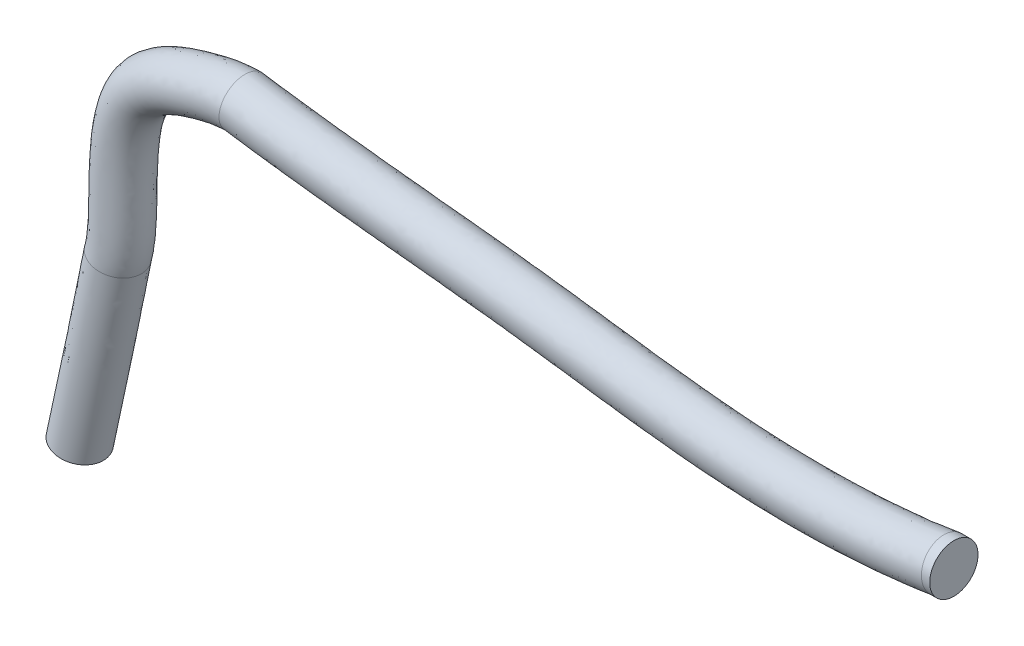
ISO-10303-21;
HEADER;
FILE_DESCRIPTION(('STEP AP214'),'2;1');
FILE_NAME('part.step','',(''),(''),'','','');
FILE_SCHEMA(('AUTOMOTIVE_DESIGN { 1 0 10303 214 1 1 1 1 }'));
ENDSEC;
DATA;
#1=APPLICATION_CONTEXT('core data for automotive mechanical design processes');
#2=APPLICATION_PROTOCOL_DEFINITION('international standard','automotive_design',2000,#1);
#3=PRODUCT_CONTEXT('',#1,'mechanical');
#4=PRODUCT('Part','Part','',(#3));
#5=PRODUCT_RELATED_PRODUCT_CATEGORY('part','',(#4));
#6=PRODUCT_DEFINITION_FORMATION('','',#4);
#7=PRODUCT_DEFINITION_CONTEXT('part definition',#1,'design');
#8=PRODUCT_DEFINITION('design','',#6,#7);
#9=PRODUCT_DEFINITION_SHAPE('','',#8);
#10=(LENGTH_UNIT() NAMED_UNIT(*) SI_UNIT(.MILLI.,.METRE.));
#11=(NAMED_UNIT(*) PLANE_ANGLE_UNIT() SI_UNIT($,.RADIAN.));
#12=(NAMED_UNIT(*) SI_UNIT($,.STERADIAN.) SOLID_ANGLE_UNIT());
#13=UNCERTAINTY_MEASURE_WITH_UNIT(LENGTH_MEASURE(1.E-05),#10,'distance_accuracy_value','');
#14=(GEOMETRIC_REPRESENTATION_CONTEXT(3) GLOBAL_UNCERTAINTY_ASSIGNED_CONTEXT((#13)) GLOBAL_UNIT_ASSIGNED_CONTEXT((#10,
#11,#12)) REPRESENTATION_CONTEXT('',''));
#15=CARTESIAN_POINT('',(0.,0.,0.));
#16=DIRECTION('',(0.,0.,1.));
#17=DIRECTION('',(1.,0.,0.));
#18=AXIS2_PLACEMENT_3D('',#15,#16,#17);
#19=CARTESIAN_POINT('',(2.72646256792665,0.,0.));
#20=DIRECTION('',(1.,0.,0.));
#21=DIRECTION('',(0.,0.,-1.));
#22=AXIS2_PLACEMENT_3D('',#19,#20,#21);
#23=PLANE('',#22);
#24=CARTESIAN_POINT('',(2.72646256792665,0.,0.));
#25=DIRECTION('',(1.,0.,0.));
#26=DIRECTION('',(0.,0.,-1.));
#27=AXIS2_PLACEMENT_3D('',#24,#25,#26);
#28=CIRCLE('',#27,8.);
#29=CARTESIAN_POINT('',(2.72646256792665,0.,-8.));
#30=VERTEX_POINT('',#29);
#31=EDGE_CURVE('E39',#30,#30,#28,.T.);
#32=ORIENTED_EDGE('',*,*,#31,.T.);
#33=EDGE_LOOP('',(#32));
#34=FACE_BOUND('',#33,.T.);
#35=ADVANCED_FACE('F36',(#34),#23,.T.);
#36=CARTESIAN_POINT('',(-287.008562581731,-108.259422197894,0.));
#37=DIRECTION('',(0.213934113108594,0.976848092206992,0.));
#38=DIRECTION('',(0.,0.,-1.));
#39=AXIS2_PLACEMENT_3D('',#36,#37,#38);
#40=PLANE('',#39);
#41=CARTESIAN_POINT('',(-287.008562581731,-108.259422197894,0.));
#42=DIRECTION('',(0.213934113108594,0.976848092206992,0.));
#43=DIRECTION('',(0.,0.,-1.));
#44=AXIS2_PLACEMENT_3D('',#41,#42,#43);
#45=CIRCLE('',#44,8.);
#46=CARTESIAN_POINT('',(-287.008562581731,-108.259422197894,-8.));
#47=VERTEX_POINT('',#46);
#48=EDGE_CURVE('E55',#47,#47,#45,.T.);
#49=ORIENTED_EDGE('',*,*,#48,.F.);
#50=EDGE_LOOP('',(#49));
#51=FACE_BOUND('',#50,.T.);
#52=ADVANCED_FACE('F171',(#51),#40,.F.);
#53=CARTESIAN_POINT('',(-1.4841553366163,0.,0.));
#54=DIRECTION('',(1.,0.,0.));
#55=DIRECTION('',(0.,0.,-1.));
#56=AXIS2_PLACEMENT_3D('',#53,#54,#55);
#57=CYLINDRICAL_SURFACE('',#56,8.);
#58=CARTESIAN_POINT('',(0.,0.,-8.));
#59=CARTESIAN_POINT('',(-0.00118239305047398,0.0150346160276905,-8.00000005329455));
#60=CARTESIAN_POINT('',(-0.00236482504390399,0.030069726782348,-7.99995766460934));
#61=CARTESIAN_POINT('',(-0.02124106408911,0.270088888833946,-7.9986036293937));
#62=CARTESIAN_POINT('',(-0.0389387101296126,0.495121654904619,-7.98783360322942));
#63=CARTESIAN_POINT('',(-0.074205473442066,0.943552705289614,-7.94735438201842));
#64=CARTESIAN_POINT('',(-0.0917745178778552,1.16695006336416,-7.91763518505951));
#65=CARTESIAN_POINT('',(-0.126693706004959,1.61096119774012,-7.83936989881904));
#66=CARTESIAN_POINT('',(-0.144043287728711,1.83156782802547,-7.79078282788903));
#67=CARTESIAN_POINT('',(-0.178372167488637,2.26807263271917,-7.67508113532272));
#68=CARTESIAN_POINT('',(-0.195351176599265,2.4839671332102,-7.6079525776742));
#69=CARTESIAN_POINT('',(-0.228771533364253,2.90891942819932,-7.45580441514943));
#70=CARTESIAN_POINT('',(-0.245213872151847,3.11798982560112,-7.37082023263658));
#71=CARTESIAN_POINT('',(-0.277485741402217,3.52833841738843,-7.18343415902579));
#72=CARTESIAN_POINT('',(-0.29331499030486,3.72961303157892,-7.08102437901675));
#73=CARTESIAN_POINT('',(-0.324240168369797,4.12283773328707,-6.85952858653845));
#74=CARTESIAN_POINT('',(-0.339336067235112,4.31478743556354,-6.74044188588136));
#75=CARTESIAN_POINT('',(-0.36867884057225,4.6878911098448,-6.48649196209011));
#76=CARTESIAN_POINT('',(-0.38292609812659,4.8690499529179,-6.35163594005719));
#77=CARTESIAN_POINT('',(-0.410465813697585,5.21922696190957,-6.06716709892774));
#78=CARTESIAN_POINT('',(-0.423759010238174,5.38825451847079,-5.91756591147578));
#79=CARTESIAN_POINT('',(-0.449294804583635,5.71295085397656,-5.6047272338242));
#80=CARTESIAN_POINT('',(-0.461538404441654,5.86863237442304,-5.44150305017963));
#81=CARTESIAN_POINT('',(-0.48490684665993,6.16576999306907,-5.1023652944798));
#82=CARTESIAN_POINT('',(-0.496031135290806,6.30721905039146,-4.92644551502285));
#83=CARTESIAN_POINT('',(-0.517075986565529,6.5748113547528,-4.56319581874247));
#84=CARTESIAN_POINT('',(-0.52699627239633,6.70095108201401,-4.37586329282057));
#85=CARTESIAN_POINT('',(-0.54552920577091,6.93660345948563,-3.99175922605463));
#86=CARTESIAN_POINT('',(-0.554145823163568,7.04616658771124,-3.79501884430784));
#87=CARTESIAN_POINT('',(-0.570045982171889,7.24834233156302,-3.39295825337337));
#88=CARTESIAN_POINT('',(-0.577329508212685,7.34095474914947,-3.1876379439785));
#89=CARTESIAN_POINT('',(-0.590510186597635,7.50855137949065,-2.7698923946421));
#90=CARTESIAN_POINT('',(-0.596407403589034,7.58353641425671,-2.55746748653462));
#91=CARTESIAN_POINT('',(-0.606773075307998,7.71533930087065,-2.1270177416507));
#92=CARTESIAN_POINT('',(-0.611241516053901,7.77215697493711,-1.90899285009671));
#93=CARTESIAN_POINT('',(-0.618706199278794,7.86707284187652,-1.46954102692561));
#94=CARTESIAN_POINT('',(-0.621706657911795,7.9052246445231,-1.24812574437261));
#95=CARTESIAN_POINT('',(-0.626233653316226,7.96278685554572,-0.802779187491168));
#96=CARTESIAN_POINT('',(-0.627759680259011,7.98219078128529,-0.578847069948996));
#97=CARTESIAN_POINT('',(-0.629324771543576,8.00209142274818,-0.13018214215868));
#98=CARTESIAN_POINT('',(-0.62936412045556,8.00259175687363,0.0945505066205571));
#99=CARTESIAN_POINT('',(-0.627956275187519,7.98469054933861,0.543261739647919));
#100=CARTESIAN_POINT('',(-0.626509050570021,7.96628862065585,0.76724030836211));
#101=CARTESIAN_POINT('',(-0.622141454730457,7.91075322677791,1.21254308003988));
#102=CARTESIAN_POINT('',(-0.619223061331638,7.8736449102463,1.43387043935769));
#103=CARTESIAN_POINT('',(-0.611935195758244,7.78097733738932,1.87260839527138));
#104=CARTESIAN_POINT('',(-0.607565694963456,7.7254177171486,2.09001891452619));
#105=CARTESIAN_POINT('',(-0.597407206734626,7.59624923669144,2.51937603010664));
#106=CARTESIAN_POINT('',(-0.591618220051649,7.52264038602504,2.73132262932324));
#107=CARTESIAN_POINT('',(-0.578662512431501,7.35790433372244,3.14825123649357));
#108=CARTESIAN_POINT('',(-0.571495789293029,7.26677710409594,3.35323323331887));
#109=CARTESIAN_POINT('',(-0.555830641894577,7.0675896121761,3.75492622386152));
#110=CARTESIAN_POINT('',(-0.547331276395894,6.9595173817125,3.95163124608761));
#111=CARTESIAN_POINT('',(-0.529065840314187,6.7272663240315,4.33522290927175));
#112=CARTESIAN_POINT('',(-0.519299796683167,6.60308783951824,4.52210975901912));
#113=CARTESIAN_POINT('',(-0.498571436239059,6.3395198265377,4.8847444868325));
#114=CARTESIAN_POINT('',(-0.4876091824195,6.20013109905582,5.06049295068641));
#115=CARTESIAN_POINT('',(-0.464566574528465,5.90713658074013,5.39962508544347));
#116=CARTESIAN_POINT('',(-0.452486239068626,5.75353102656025,5.56300896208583));
#117=CARTESIAN_POINT('',(-0.427224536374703,5.4323198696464,5.87712832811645));
#118=CARTESIAN_POINT('',(-0.414037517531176,5.26464240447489,6.02778988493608));
#119=CARTESIAN_POINT('',(-0.386719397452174,4.91728307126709,6.31434905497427));
#120=CARTESIAN_POINT('',(-0.372588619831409,4.73760531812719,6.45025168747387));
#121=CARTESIAN_POINT('',(-0.343470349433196,4.36735629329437,6.70648324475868));
#122=CARTESIAN_POINT('',(-0.32848229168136,4.17677783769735,6.82680172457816));
#123=CARTESIAN_POINT('',(-0.297765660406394,3.78620490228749,7.05091083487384));
#124=CARTESIAN_POINT('',(-0.282037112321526,3.58621074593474,7.15470203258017));
#125=CARTESIAN_POINT('',(-0.249939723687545,3.17808076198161,7.34510349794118));
#126=CARTESIAN_POINT('',(-0.233570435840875,2.96993924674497,7.43170149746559));
#127=CARTESIAN_POINT('',(-0.200318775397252,2.54713201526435,7.58701764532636));
#128=CARTESIAN_POINT('',(-0.183436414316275,2.33246644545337,7.6557361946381));
#129=CARTESIAN_POINT('',(-0.149308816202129,1.89852104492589,7.77471243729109));
#130=CARTESIAN_POINT('',(-0.13206426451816,1.67924992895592,7.82500216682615));
#131=CARTESIAN_POINT('',(-0.0973121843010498,1.23736367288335,7.90691968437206));
#132=CARTESIAN_POINT('',(-0.0798048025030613,1.01475039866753,7.93855751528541));
#133=CARTESIAN_POINT('',(-0.0524752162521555,0.667243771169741,7.97310059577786));
#134=CARTESIAN_POINT('',(-0.0427007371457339,0.542957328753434,7.98252681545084));
#135=CARTESIAN_POINT('',(-0.0231332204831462,0.294148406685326,7.99555986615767));
#136=CARTESIAN_POINT('',(-0.0133401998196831,0.169626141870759,7.99917060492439));
#137=CARTESIAN_POINT('',(-0.00236484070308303,0.0300699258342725,7.99995763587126));
#138=CARTESIAN_POINT('',(-0.00118240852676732,0.0150348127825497,8.00000002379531));
#139=CARTESIAN_POINT('',(0.,0.,8.));
#140=B_SPLINE_CURVE_WITH_KNOTS('',3,(#58,#59,#60,#61,#62,#63,#64,#65,#66,#67,#68,#69,#70,#71,
#72,#73,#74,#75,#76,#77,#78,#79,#80,#81,#82,#83,#84,#85,#86,#87,#88,#89,#90,#91,#92,#93,#94,#95,
#96,#97,#98,#99,#100,#101,#102,#103,#104,#105,#106,#107,#108,#109,#110,#111,#112,#113,#114,#115,
#116,#117,#118,#119,#120,#121,#122,#123,#124,#125,#126,#127,#128,#129,#130,#131,#132,#133,#134,
#135,#136,#137,#138,#139),.UNSPECIFIED.,.F.,.F.,(4,2,2,2,2,2,2,2,2,2,2,2,2,2,2,2,2,2,2,2,2,2,2,
2,2,2,2,2,2,2,2,2,2,2,2,2,2,2,2,2,4),(0.,0.0452445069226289,0.722268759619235,1.39965066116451,
2.07851216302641,2.75788530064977,3.43592319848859,4.11426887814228,4.79264255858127,
5.47070765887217,6.14824208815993,6.82512229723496,7.50233573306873,8.1797045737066,
8.85496731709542,9.53023794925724,10.20547708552,10.8807228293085,11.5540176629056,
12.2275452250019,12.9009438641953,13.5743562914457,14.2468657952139,14.9193885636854,
15.5919109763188,16.2644344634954,16.9374351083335,17.6104214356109,18.2833723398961,
18.9563120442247,19.6329260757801,20.3093092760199,20.9861434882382,21.662954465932,
22.3402466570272,23.017523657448,23.6936176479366,24.3693472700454,24.744314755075,
25.1190301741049,25.1642746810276),.UNSPECIFIED.);
#141=CARTESIAN_POINT('',(0.,0.,8.));
#142=VERTEX_POINT('',#141);
#143=CARTESIAN_POINT('',(0.,0.,-8.));
#144=VERTEX_POINT('',#143);
#145=EDGE_CURVE('E153',#142,#144,#140,.F.);
#146=ORIENTED_EDGE('',*,*,#145,.F.);
#147=CARTESIAN_POINT('',(0.,0.,-8.));
#148=CARTESIAN_POINT('',(0.00118239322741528,-0.015034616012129,-8.00000005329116));
#149=CARTESIAN_POINT('',(0.00236477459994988,-0.0300697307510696,-7.99995766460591));
#150=CARTESIAN_POINT('',(0.0212383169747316,-0.270075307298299,-7.99860370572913));
#151=CARTESIAN_POINT('',(0.0389220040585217,-0.495095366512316,-7.98783489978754));
#152=CARTESIAN_POINT('',(0.0741384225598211,-0.943502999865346,-7.94735994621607));
#153=CARTESIAN_POINT('',(0.091671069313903,-1.16688964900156,-7.91764379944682));
#154=CARTESIAN_POINT('',(0.12649589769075,-1.61088130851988,-7.83938601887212));
#155=CARTESIAN_POINT('',(0.143787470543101,-1.83147917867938,-7.79080341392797));
#156=CARTESIAN_POINT('',(0.177980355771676,-2.26796843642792,-7.67511166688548));
#157=CARTESIAN_POINT('',(0.194881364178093,-2.48385615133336,-7.60798858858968));
#158=CARTESIAN_POINT('',(0.228128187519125,-2.90879714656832,-7.45585191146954));
#159=CARTESIAN_POINT('',(0.244475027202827,-3.11786301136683,-7.37087369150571));
#160=CARTESIAN_POINT('',(0.276540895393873,-3.52820398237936,-7.18349999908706));
#161=CARTESIAN_POINT('',(0.292259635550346,-3.72947550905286,-7.08109663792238));
#162=CARTESIAN_POINT('',(0.322951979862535,-4.12269517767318,-6.85961408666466));
#163=CARTESIAN_POINT('',(0.337925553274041,-4.31464293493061,-6.74053420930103));
#164=CARTESIAN_POINT('',(0.367015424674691,-4.68774361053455,-6.48659837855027));
#165=CARTESIAN_POINT('',(0.38113210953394,-4.86890139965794,-6.35174962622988));
#166=CARTESIAN_POINT('',(0.408405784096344,-5.21907138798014,-6.06730046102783));
#167=CARTESIAN_POINT('',(0.421563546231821,-5.38809336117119,-5.91771215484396));
#168=CARTESIAN_POINT('',(0.446827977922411,-5.71278002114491,-5.60490083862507));
#169=CARTESIAN_POINT('',(0.458935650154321,-5.86845744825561,-5.44169113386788));
#170=CARTESIAN_POINT('',(0.482035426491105,-6.16558850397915,-5.10258399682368));
#171=CARTESIAN_POINT('',(0.493026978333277,-6.30703509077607,-4.9266803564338));
#172=CARTESIAN_POINT('',(0.513813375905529,-6.57462428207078,-4.56346462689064));
#173=CARTESIAN_POINT('',(0.523607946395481,-6.7007633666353,-4.37614992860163));
#174=CARTESIAN_POINT('',(0.541900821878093,-6.93642109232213,-3.99207572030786));
#175=CARTESIAN_POINT('',(0.550403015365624,-7.04598958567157,-3.79534698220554));
#176=CARTESIAN_POINT('',(0.566088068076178,-7.24817719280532,-3.39331048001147));
#177=CARTESIAN_POINT('',(0.573270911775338,-7.34079610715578,-3.18800261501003));
#178=CARTESIAN_POINT('',(0.586266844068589,-7.50840717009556,-2.77028254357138));
#179=CARTESIAN_POINT('',(0.592079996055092,-7.5834001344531,-2.55787066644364));
#180=CARTESIAN_POINT('',(0.602296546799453,-7.71522055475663,-2.1274473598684));
#181=CARTESIAN_POINT('',(0.606699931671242,-7.77204783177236,-1.90943587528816));
#182=CARTESIAN_POINT('',(0.614055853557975,-7.86698888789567,-1.46999172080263));
#183=CARTESIAN_POINT('',(0.617012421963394,-7.90515466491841,-1.24857035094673));
#184=CARTESIAN_POINT('',(0.621473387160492,-7.96274355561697,-0.803210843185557));
#185=CARTESIAN_POINT('',(0.622977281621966,-7.98216018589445,-0.579271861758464));
#186=CARTESIAN_POINT('',(0.624520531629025,-8.00208496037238,-0.130592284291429));
#187=CARTESIAN_POINT('',(0.624560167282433,-8.00259672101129,0.0941481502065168));
#188=CARTESIAN_POINT('',(0.623175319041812,-7.98471700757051,0.542875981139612));
#189=CARTESIAN_POINT('',(0.621750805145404,-7.96632514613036,0.766863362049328));
#190=CARTESIAN_POINT('',(0.617450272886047,-7.91080688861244,1.21219662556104));
#191=CARTESIAN_POINT('',(0.614576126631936,-7.87370465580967,1.43354553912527));
#192=CARTESIAN_POINT('',(0.607397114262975,-7.78104557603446,1.87232729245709));
#193=CARTESIAN_POINT('',(0.603092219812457,-7.72548836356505,2.0897600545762));
#194=CARTESIAN_POINT('',(0.593081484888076,-7.5963207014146,2.51916248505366));
#195=CARTESIAN_POINT('',(0.587375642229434,-7.52271022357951,2.73113214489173));
#196=CARTESIAN_POINT('',(0.574602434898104,-7.35796681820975,3.14810681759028));
#197=CARTESIAN_POINT('',(0.567535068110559,-7.26683386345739,3.35311181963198));
#198=CARTESIAN_POINT('',(0.552082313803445,-7.06763311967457,3.75484543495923));
#199=CARTESIAN_POINT('',(0.543696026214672,-6.95955376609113,3.95156827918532));
#200=CARTESIAN_POINT('',(0.525667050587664,-6.72728492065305,4.33519506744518));
#201=CARTESIAN_POINT('',(0.516024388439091,-6.60309576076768,4.52209921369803));
#202=CARTESIAN_POINT('',(0.495549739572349,-6.3395045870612,4.88476510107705));
#203=CARTESIAN_POINT('',(0.484717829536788,-6.20010355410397,5.06052755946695));
#204=CARTESIAN_POINT('',(0.461939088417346,-5.90708158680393,5.39968601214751));
#205=CARTESIAN_POINT('',(0.449992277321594,-5.75346090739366,5.56308222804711));
#206=CARTESIAN_POINT('',(0.425037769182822,-5.43273111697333,5.87672145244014));
#207=CARTESIAN_POINT('',(0.412027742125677,-5.26559239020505,6.02693399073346));
#208=CARTESIAN_POINT('',(0.385064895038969,-4.91938114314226,6.31268975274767));
#209=CARTESIAN_POINT('',(0.371112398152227,-4.74031271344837,6.44823796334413));
#210=CARTESIAN_POINT('',(0.342347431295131,-4.37134057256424,6.70386355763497));
#211=CARTESIAN_POINT('',(0.32753438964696,-4.18142965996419,6.82393048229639));
#212=CARTESIAN_POINT('',(0.297159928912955,-3.79223721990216,7.04764608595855));
#213=CARTESIAN_POINT('',(0.281598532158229,-3.59295597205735,7.15129525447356));
#214=CARTESIAN_POINT('',(0.249736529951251,-3.18517153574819,7.34204768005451));
#215=CARTESIAN_POINT('',(0.233431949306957,-2.97661895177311,7.42904468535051));
#216=CARTESIAN_POINT('',(0.200288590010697,-2.55294474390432,7.585079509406));
#217=CARTESIAN_POINT('',(0.183449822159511,-2.33782325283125,7.6541176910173));
#218=CARTESIAN_POINT('',(0.149386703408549,-1.90293146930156,7.77364946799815));
#219=CARTESIAN_POINT('',(0.132163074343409,-1.68316991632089,7.82417511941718));
#220=CARTESIAN_POINT('',(0.0974296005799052,-1.24028090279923,7.9064776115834));
#221=CARTESIAN_POINT('',(0.0799199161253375,-1.01715533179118,7.93826460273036));
#222=CARTESIAN_POINT('',(0.0525666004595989,-0.668818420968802,7.97297363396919));
#223=CARTESIAN_POINT('',(0.0427787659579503,-0.54421759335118,7.9824459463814));
#224=CARTESIAN_POINT('',(0.0231774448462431,-0.294778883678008,7.99554156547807));
#225=CARTESIAN_POINT('',(0.0133639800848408,-0.16994121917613,7.9991688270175));
#226=CARTESIAN_POINT('',(0.00236479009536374,-0.0300699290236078,7.99995763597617));
#227=CARTESIAN_POINT('',(0.00118240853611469,-0.0150348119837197,8.00000002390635));
#228=CARTESIAN_POINT('',(0.,0.,8.));
#229=B_SPLINE_CURVE_WITH_KNOTS('',3,(#147,#148,#149,#150,#151,#152,#153,#154,#155,#156,#157,
#158,#159,#160,#161,#162,#163,#164,#165,#166,#167,#168,#169,#170,#171,#172,#173,#174,#175,#176,
#177,#178,#179,#180,#181,#182,#183,#184,#185,#186,#187,#188,#189,#190,#191,#192,#193,#194,#195,
#196,#197,#198,#199,#200,#201,#202,#203,#204,#205,#206,#207,#208,#209,#210,#211,#212,#213,#214,
#215,#216,#217,#218,#219,#220,#221,#222,#223,#224,#225,#226,#227,#228),.UNSPECIFIED.,.F.,.F.,(4,
2,2,2,2,2,2,2,2,2,2,2,2,2,2,2,2,2,2,2,2,2,2,2,2,2,2,2,2,2,2,2,2,2,2,2,2,2,2,2,4),(0.,
0.0452445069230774,0.722227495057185,1.39956804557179,2.078387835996,2.75771926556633,
3.43571712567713,4.11402274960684,4.79235633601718,5.47038135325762,6.14785402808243,
6.82467252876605,7.50182430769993,8.17913150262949,8.85435866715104,9.52959377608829,
10.2047976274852,10.8800081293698,11.5533263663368,12.2268773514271,12.9002994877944,
13.5737354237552,14.2463038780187,14.9188856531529,15.5914684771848,16.2640523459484,
16.9370972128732,17.6101282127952,18.2831158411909,18.9560914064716,19.6305835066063,
20.3048455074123,20.9795606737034,21.6542557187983,22.3331218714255,23.0119743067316,
23.6896456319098,24.3669495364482,24.7428673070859,25.118530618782,25.1637751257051),.UNSPECIFIED.);
#230=EDGE_CURVE('E70',#142,#144,#229,.F.);
#231=ORIENTED_EDGE('',*,*,#230,.T.);
#232=EDGE_LOOP('',(#146,#231));
#233=FACE_BOUND('',#232,.T.);
#234=ORIENTED_EDGE('',*,*,#31,.F.);
#235=EDGE_LOOP('',(#234));
#236=FACE_BOUND('',#235,.T.);
#237=ADVANCED_FACE('F127',(#233,#236),#57,.T.);
#238=CARTESIAN_POINT('',(-234.227374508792,16.6000432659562,-8.));
#239=CARTESIAN_POINT('',(-233.760144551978,16.5296979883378,-8.));
#240=CARTESIAN_POINT('',(-233.292914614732,16.4593525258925,-8.));
#241=CARTESIAN_POINT('',(-231.830526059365,16.2391785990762,-8.));
#242=CARTESIAN_POINT('',(-230.835116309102,16.0917260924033,-8.));
#243=CARTESIAN_POINT('',(-228.843819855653,15.8013295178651,-8.));
#244=CARTESIAN_POINT('',(-227.8479331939,15.6583850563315,-8.));
#245=CARTESIAN_POINT('',(-224.859596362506,15.235943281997,-8.));
#246=CARTESIAN_POINT('',(-222.866469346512,14.9628375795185,-8.));
#247=CARTESIAN_POINT('',(-216.884688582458,14.1661279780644,-8.));
#248=CARTESIAN_POINT('',(-212.8936351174,13.665131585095,-8.));
#249=CARTESIAN_POINT('',(-200.913337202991,12.2289009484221,-8.));
#250=CARTESIAN_POINT('',(-192.916955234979,11.3604252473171,-8.));
#251=CARTESIAN_POINT('',(-168.9189500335,8.83266046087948,-8.));
#252=CARTESIAN_POINT('',(-152.908467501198,7.25103369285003,-8.));
#253=CARTESIAN_POINT('',(-114.272882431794,2.45341051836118,-8.));
#254=CARTESIAN_POINT('',(-91.6890619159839,-1.16980504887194,-8.));
#255=CARTESIAN_POINT('',(-57.4125625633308,-3.4493801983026,-8.));
#256=CARTESIAN_POINT('',(-45.8738247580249,-3.67792730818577,-8.));
#257=CARTESIAN_POINT('',(-28.6086006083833,-3.05934701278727,-8.));
#258=CARTESIAN_POINT('',(-22.8606729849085,-2.69292008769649,-8.));
#259=CARTESIAN_POINT('',(-14.2646911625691,-1.88313359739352,-8.));
#260=CARTESIAN_POINT('',(-11.4036821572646,-1.56984708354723,-8.));
#261=CARTESIAN_POINT('',(-7.12054467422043,-1.03240630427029,-8.));
#262=CARTESIAN_POINT('',(-5.69422818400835,-0.842007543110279,-8.));
#263=CARTESIAN_POINT('',(-3.55708478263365,-0.539222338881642,-8.));
#264=CARTESIAN_POINT('',(-2.84509220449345,-0.435429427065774,-8.));
#265=CARTESIAN_POINT('',(-1.42192371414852,-0.222063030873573,-8.));
#266=CARTESIAN_POINT('',(-0.710747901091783,-0.112488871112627,-8.));
#267=CARTESIAN_POINT('',(0.488636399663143,0.0773356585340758,-8.));
#268=CARTESIAN_POINT('',(0.977272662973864,0.15467224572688,-8.));
#269=CARTESIAN_POINT('',(1.465908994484,0.23200836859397,-8.));
#270=CARTESIAN_POINT('',(-231.845291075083,32.421727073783,-8.));
#271=CARTESIAN_POINT('',(-231.378061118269,32.3513817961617,-8.));
#272=CARTESIAN_POINT('',(-230.904955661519,32.280151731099,-8.));
#273=CARTESIAN_POINT('',(-229.460956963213,32.0627465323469,-8.));
#274=CARTESIAN_POINT('',(-228.502455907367,31.9207902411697,-8.));
#275=CARTESIAN_POINT('',(-226.558672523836,31.6373226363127,-8.));
#276=CARTESIAN_POINT('',(-225.5859047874,31.4976951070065,-8.));
#277=CARTESIAN_POINT('',(-222.665004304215,31.084786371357,-8.));
#278=CARTESIAN_POINT('',(-220.714274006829,30.8174794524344,-8.));
#279=CARTESIAN_POINT('',(-214.851950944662,30.0366803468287,-8.));
#280=CARTESIAN_POINT('',(-210.930222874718,29.5443171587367,-8.));
#281=CARTESIAN_POINT('',(-199.126701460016,28.1292789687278,-8.));
#282=CARTESIAN_POINT('',(-191.206549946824,27.2687786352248,-8.));
#283=CARTESIAN_POINT('',(-167.311627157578,24.7518717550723,-8.));
#284=CARTESIAN_POINT('',(-151.202133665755,23.1620335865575,-8.));
#285=CARTESIAN_POINT('',(-111.92460530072,18.2846962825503,-8.));
#286=CARTESIAN_POINT('',(-89.6410404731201,14.7293350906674,-8.));
#287=CARTESIAN_POINT('',(-56.8479078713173,12.5484119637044,-8.));
#288=CARTESIAN_POINT('',(-45.8529360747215,12.3330870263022,-8.));
#289=CARTESIAN_POINT('',(-29.4783681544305,12.9197567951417,-8.));
#290=CARTESIAN_POINT('',(-24.0397611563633,13.2668438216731,-8.));
#291=CARTESIAN_POINT('',(-15.9261065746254,14.0311925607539,-8.));
#292=CARTESIAN_POINT('',(-13.228922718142,14.326591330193,-8.));
#293=CARTESIAN_POINT('',(-9.19597218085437,14.8326390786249,-8.));
#294=CARTESIAN_POINT('',(-7.85379221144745,15.0118131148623,-8.));
#295=CARTESIAN_POINT('',(-5.84394294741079,15.2965635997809,-8.));
#296=CARTESIAN_POINT('',(-5.17456326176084,15.3941453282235,-8.));
#297=CARTESIAN_POINT('',(-3.83697935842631,15.5946805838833,-8.));
#298=CARTESIAN_POINT('',(-3.19034967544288,15.6942201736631,-8.));
#299=CARTESIAN_POINT('',(-2.02737201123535,15.87828272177,-8.));
#300=CARTESIAN_POINT('',(-1.52390346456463,15.9579667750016,-8.));
#301=CARTESIAN_POINT('',(-1.03526713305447,16.0353028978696,-8.));
#302=CARTESIAN_POINT('',(-231.845291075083,32.421727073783,8.));
#303=CARTESIAN_POINT('',(-231.378061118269,32.3513817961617,8.));
#304=CARTESIAN_POINT('',(-230.904955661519,32.280151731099,8.));
#305=CARTESIAN_POINT('',(-229.460956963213,32.0627465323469,8.));
#306=CARTESIAN_POINT('',(-228.502455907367,31.9207902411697,8.));
#307=CARTESIAN_POINT('',(-226.558672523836,31.6373226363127,8.));
#308=CARTESIAN_POINT('',(-225.5859047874,31.4976951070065,8.));
#309=CARTESIAN_POINT('',(-222.665004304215,31.084786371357,8.));
#310=CARTESIAN_POINT('',(-220.714274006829,30.8174794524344,8.));
#311=CARTESIAN_POINT('',(-214.851950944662,30.0366803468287,8.));
#312=CARTESIAN_POINT('',(-210.930222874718,29.5443171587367,8.));
#313=CARTESIAN_POINT('',(-199.126701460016,28.1292789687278,8.));
#314=CARTESIAN_POINT('',(-191.206549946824,27.2687786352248,8.));
#315=CARTESIAN_POINT('',(-167.311627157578,24.7518717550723,8.));
#316=CARTESIAN_POINT('',(-151.202133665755,23.1620335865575,8.));
#317=CARTESIAN_POINT('',(-111.92460530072,18.2846962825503,8.));
#318=CARTESIAN_POINT('',(-89.6410404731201,14.7293350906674,8.));
#319=CARTESIAN_POINT('',(-56.8479078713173,12.5484119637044,8.));
#320=CARTESIAN_POINT('',(-45.8529360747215,12.3330870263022,8.));
#321=CARTESIAN_POINT('',(-29.4783681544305,12.9197567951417,8.));
#322=CARTESIAN_POINT('',(-24.0397611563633,13.2668438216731,8.));
#323=CARTESIAN_POINT('',(-15.9261065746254,14.0311925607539,8.));
#324=CARTESIAN_POINT('',(-13.228922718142,14.326591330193,8.));
#325=CARTESIAN_POINT('',(-9.19597218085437,14.8326390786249,8.));
#326=CARTESIAN_POINT('',(-7.85379221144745,15.0118131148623,8.));
#327=CARTESIAN_POINT('',(-5.84394294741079,15.2965635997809,8.));
#328=CARTESIAN_POINT('',(-5.17456326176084,15.3941453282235,8.));
#329=CARTESIAN_POINT('',(-3.83697935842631,15.5946805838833,8.));
#330=CARTESIAN_POINT('',(-3.19034967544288,15.6942201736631,8.));
#331=CARTESIAN_POINT('',(-2.02737201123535,15.87828272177,8.));
#332=CARTESIAN_POINT('',(-1.52390346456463,15.9579667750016,8.));
#333=CARTESIAN_POINT('',(-1.03526713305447,16.0353028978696,8.));
#334=CARTESIAN_POINT('',(-234.227374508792,16.6000432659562,8.));
#335=CARTESIAN_POINT('',(-233.760144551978,16.5296979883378,8.));
#336=CARTESIAN_POINT('',(-233.292914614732,16.4593525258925,8.));
#337=CARTESIAN_POINT('',(-231.830526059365,16.2391785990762,8.));
#338=CARTESIAN_POINT('',(-230.835116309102,16.0917260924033,8.));
#339=CARTESIAN_POINT('',(-228.843819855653,15.8013295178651,8.));
#340=CARTESIAN_POINT('',(-227.8479331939,15.6583850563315,8.));
#341=CARTESIAN_POINT('',(-224.859596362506,15.235943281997,8.));
#342=CARTESIAN_POINT('',(-222.866469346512,14.9628375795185,8.));
#343=CARTESIAN_POINT('',(-216.884688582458,14.1661279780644,8.));
#344=CARTESIAN_POINT('',(-212.8936351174,13.665131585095,8.));
#345=CARTESIAN_POINT('',(-200.913337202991,12.2289009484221,8.));
#346=CARTESIAN_POINT('',(-192.916955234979,11.3604252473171,8.));
#347=CARTESIAN_POINT('',(-168.9189500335,8.83266046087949,8.));
#348=CARTESIAN_POINT('',(-152.908467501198,7.25103369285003,8.));
#349=CARTESIAN_POINT('',(-114.272882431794,2.45341051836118,8.));
#350=CARTESIAN_POINT('',(-91.6890619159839,-1.16980504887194,8.));
#351=CARTESIAN_POINT('',(-57.4125625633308,-3.4493801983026,8.));
#352=CARTESIAN_POINT('',(-45.8738247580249,-3.67792730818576,8.));
#353=CARTESIAN_POINT('',(-28.6086006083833,-3.05934701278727,8.));
#354=CARTESIAN_POINT('',(-22.8606729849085,-2.69292008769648,8.));
#355=CARTESIAN_POINT('',(-14.2646911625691,-1.88313359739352,8.));
#356=CARTESIAN_POINT('',(-11.4036821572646,-1.56984708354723,8.));
#357=CARTESIAN_POINT('',(-7.12054467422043,-1.03240630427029,8.));
#358=CARTESIAN_POINT('',(-5.69422818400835,-0.842007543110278,8.));
#359=CARTESIAN_POINT('',(-3.55708478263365,-0.539222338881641,8.));
#360=CARTESIAN_POINT('',(-2.84509220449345,-0.435429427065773,8.));
#361=CARTESIAN_POINT('',(-1.42192371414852,-0.222063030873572,8.));
#362=CARTESIAN_POINT('',(-0.710747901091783,-0.112488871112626,8.));
#363=CARTESIAN_POINT('',(0.488636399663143,0.0773356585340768,8.));
#364=CARTESIAN_POINT('',(0.977272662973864,0.154672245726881,8.));
#365=CARTESIAN_POINT('',(1.46590899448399,0.232008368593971,8.));
#366=CARTESIAN_POINT('',(-236.609457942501,0.778359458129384,8.));
#367=CARTESIAN_POINT('',(-236.142227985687,0.708014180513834,8.));
#368=CARTESIAN_POINT('',(-235.680873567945,0.638553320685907,8.));
#369=CARTESIAN_POINT('',(-234.200095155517,0.415610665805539,8.));
#370=CARTESIAN_POINT('',(-233.167776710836,0.262661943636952,8.));
#371=CARTESIAN_POINT('',(-231.128967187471,-0.0346636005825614,8.));
#372=CARTESIAN_POINT('',(-230.1099616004,-0.180924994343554,8.));
#373=CARTESIAN_POINT('',(-227.054188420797,-0.612899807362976,8.));
#374=CARTESIAN_POINT('',(-225.018664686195,-0.89180429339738,8.));
#375=CARTESIAN_POINT('',(-218.917426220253,-1.70442439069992,8.));
#376=CARTESIAN_POINT('',(-214.857047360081,-2.2140539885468,8.));
#377=CARTESIAN_POINT('',(-202.699972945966,-3.67147707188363,8.));
#378=CARTESIAN_POINT('',(-194.627360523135,-4.54792814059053,8.));
#379=CARTESIAN_POINT('',(-170.526272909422,-7.08655083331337,8.));
#380=CARTESIAN_POINT('',(-154.614801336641,-8.65996620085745,8.));
#381=CARTESIAN_POINT('',(-116.621159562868,-13.377875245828,8.));
#382=CARTESIAN_POINT('',(-93.7370833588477,-17.0689451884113,8.));
#383=CARTESIAN_POINT('',(-57.9772172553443,-19.4471723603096,8.));
#384=CARTESIAN_POINT('',(-45.8947134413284,-19.6889416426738,8.));
#385=CARTESIAN_POINT('',(-27.738833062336,-19.0384508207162,8.));
#386=CARTESIAN_POINT('',(-21.6815848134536,-18.6526839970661,8.));
#387=CARTESIAN_POINT('',(-12.6032757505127,-17.7974597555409,8.));
#388=CARTESIAN_POINT('',(-9.57844159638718,-17.4662854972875,8.));
#389=CARTESIAN_POINT('',(-5.04511716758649,-16.8974516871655,8.));
#390=CARTESIAN_POINT('',(-3.53466415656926,-16.6958282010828,8.));
#391=CARTESIAN_POINT('',(-1.27022661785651,-16.3750082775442,8.));
#392=CARTESIAN_POINT('',(-0.515621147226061,-16.2650041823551,8.));
#393=CARTESIAN_POINT('',(0.993131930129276,-16.0388066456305,8.));
#394=CARTESIAN_POINT('',(1.76885387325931,-15.9191979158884,8.));
#395=CARTESIAN_POINT('',(3.00464481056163,-15.7236114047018,8.));
#396=CARTESIAN_POINT('',(3.47844879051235,-15.6486222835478,8.));
#397=CARTESIAN_POINT('',(3.96708512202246,-15.5712861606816,8.));
#398=CARTESIAN_POINT('',(-236.609457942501,0.778359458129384,-8.));
#399=CARTESIAN_POINT('',(-236.142227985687,0.708014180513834,-8.));
#400=CARTESIAN_POINT('',(-235.680873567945,0.638553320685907,-8.));
#401=CARTESIAN_POINT('',(-234.200095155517,0.415610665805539,-8.));
#402=CARTESIAN_POINT('',(-233.167776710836,0.262661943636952,-8.));
#403=CARTESIAN_POINT('',(-231.128967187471,-0.0346636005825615,-8.));
#404=CARTESIAN_POINT('',(-230.1099616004,-0.180924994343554,-8.));
#405=CARTESIAN_POINT('',(-227.054188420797,-0.612899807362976,-8.));
#406=CARTESIAN_POINT('',(-225.018664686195,-0.89180429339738,-8.));
#407=CARTESIAN_POINT('',(-218.917426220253,-1.70442439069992,-8.));
#408=CARTESIAN_POINT('',(-214.857047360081,-2.2140539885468,-8.));
#409=CARTESIAN_POINT('',(-202.699972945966,-3.67147707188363,-8.));
#410=CARTESIAN_POINT('',(-194.627360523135,-4.54792814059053,-8.));
#411=CARTESIAN_POINT('',(-170.526272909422,-7.08655083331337,-8.));
#412=CARTESIAN_POINT('',(-154.614801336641,-8.65996620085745,-8.));
#413=CARTESIAN_POINT('',(-116.621159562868,-13.377875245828,-8.));
#414=CARTESIAN_POINT('',(-93.7370833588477,-17.0689451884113,-8.));
#415=CARTESIAN_POINT('',(-57.9772172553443,-19.4471723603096,-8.));
#416=CARTESIAN_POINT('',(-45.8947134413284,-19.6889416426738,-8.));
#417=CARTESIAN_POINT('',(-27.738833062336,-19.0384508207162,-8.));
#418=CARTESIAN_POINT('',(-21.6815848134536,-18.6526839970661,-8.));
#419=CARTESIAN_POINT('',(-12.6032757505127,-17.7974597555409,-8.));
#420=CARTESIAN_POINT('',(-9.57844159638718,-17.4662854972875,-8.));
#421=CARTESIAN_POINT('',(-5.04511716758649,-16.8974516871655,-8.));
#422=CARTESIAN_POINT('',(-3.53466415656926,-16.6958282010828,-8.));
#423=CARTESIAN_POINT('',(-1.27022661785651,-16.3750082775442,-8.));
#424=CARTESIAN_POINT('',(-0.515621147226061,-16.2650041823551,-8.));
#425=CARTESIAN_POINT('',(0.993131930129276,-16.0388066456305,-8.));
#426=CARTESIAN_POINT('',(1.76885387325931,-15.9191979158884,-8.));
#427=CARTESIAN_POINT('',(3.00464481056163,-15.7236114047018,-8.));
#428=CARTESIAN_POINT('',(3.47844879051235,-15.6486222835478,-8.));
#429=CARTESIAN_POINT('',(3.96708512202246,-15.5712861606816,-8.));
#430=CARTESIAN_POINT('',(-234.227374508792,16.6000432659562,-8.));
#431=CARTESIAN_POINT('',(-233.760144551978,16.5296979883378,-8.));
#432=CARTESIAN_POINT('',(-233.292914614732,16.4593525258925,-8.));
#433=CARTESIAN_POINT('',(-231.830526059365,16.2391785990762,-8.));
#434=CARTESIAN_POINT('',(-230.835116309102,16.0917260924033,-8.));
#435=CARTESIAN_POINT('',(-228.843819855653,15.8013295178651,-8.));
#436=CARTESIAN_POINT('',(-227.8479331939,15.6583850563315,-8.));
#437=CARTESIAN_POINT('',(-224.859596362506,15.235943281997,-8.));
#438=CARTESIAN_POINT('',(-222.866469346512,14.9628375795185,-8.));
#439=CARTESIAN_POINT('',(-216.884688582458,14.1661279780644,-8.));
#440=CARTESIAN_POINT('',(-212.8936351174,13.665131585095,-8.));
#441=CARTESIAN_POINT('',(-200.913337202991,12.2289009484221,-8.));
#442=CARTESIAN_POINT('',(-192.916955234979,11.3604252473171,-8.));
#443=CARTESIAN_POINT('',(-168.9189500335,8.83266046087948,-8.));
#444=CARTESIAN_POINT('',(-152.908467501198,7.25103369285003,-8.));
#445=CARTESIAN_POINT('',(-114.272882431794,2.45341051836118,-8.));
#446=CARTESIAN_POINT('',(-91.6890619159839,-1.16980504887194,-8.));
#447=CARTESIAN_POINT('',(-57.4125625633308,-3.4493801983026,-8.));
#448=CARTESIAN_POINT('',(-45.8738247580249,-3.67792730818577,-8.));
#449=CARTESIAN_POINT('',(-28.6086006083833,-3.05934701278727,-8.));
#450=CARTESIAN_POINT('',(-22.8606729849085,-2.69292008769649,-8.));
#451=CARTESIAN_POINT('',(-14.2646911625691,-1.88313359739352,-8.));
#452=CARTESIAN_POINT('',(-11.4036821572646,-1.56984708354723,-8.));
#453=CARTESIAN_POINT('',(-7.12054467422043,-1.03240630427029,-8.));
#454=CARTESIAN_POINT('',(-5.69422818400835,-0.842007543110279,-8.));
#455=CARTESIAN_POINT('',(-3.55708478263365,-0.539222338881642,-8.));
#456=CARTESIAN_POINT('',(-2.84509220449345,-0.435429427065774,-8.));
#457=CARTESIAN_POINT('',(-1.42192371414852,-0.222063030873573,-8.));
#458=CARTESIAN_POINT('',(-0.710747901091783,-0.112488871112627,-8.));
#459=CARTESIAN_POINT('',(0.488636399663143,0.0773356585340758,-8.));
#460=CARTESIAN_POINT('',(0.977272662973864,0.15467224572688,-8.));
#461=CARTESIAN_POINT('',(1.465908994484,0.23200836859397,-8.));
#462=(BOUNDED_SURFACE() B_SPLINE_SURFACE(3,3,((#238,#239,#240,#241,#242,#243,#244,#245,#246,
#247,#248,#249,#250,#251,#252,#253,#254,#255,#256,#257,#258,#259,#260,#261,#262,#263,#264,#265,
#266,#267,#268,#269),(#270,#271,#272,#273,#274,#275,#276,#277,#278,#279,#280,#281,#282,#283,
#284,#285,#286,#287,#288,#289,#290,#291,#292,#293,#294,#295,#296,#297,#298,#299,#300,#301),
(#302,#303,#304,#305,#306,#307,#308,#309,#310,#311,#312,#313,#314,#315,#316,#317,#318,#319,#320,
#321,#322,#323,#324,#325,#326,#327,#328,#329,#330,#331,#332,#333),(#334,#335,#336,#337,#338,
#339,#340,#341,#342,#343,#344,#345,#346,#347,#348,#349,#350,#351,#352,#353,#354,#355,#356,#357,
#358,#359,#360,#361,#362,#363,#364,#365),(#366,#367,#368,#369,#370,#371,#372,#373,#374,#375,
#376,#377,#378,#379,#380,#381,#382,#383,#384,#385,#386,#387,#388,#389,#390,#391,#392,#393,#394,
#395,#396,#397),(#398,#399,#400,#401,#402,#403,#404,#405,#406,#407,#408,#409,#410,#411,#412,
#413,#414,#415,#416,#417,#418,#419,#420,#421,#422,#423,#424,#425,#426,#427,#428,#429),(#430,
#431,#432,#433,#434,#435,#436,#437,#438,#439,#440,#441,#442,#443,#444,#445,#446,#447,#448,#449,
#450,#451,#452,#453,#454,#455,#456,#457,#458,#459,#460,#461)),.UNSPECIFIED.,.T.,.F.,
.F.) B_SPLINE_SURFACE_WITH_KNOTS((4,3,4),(4,2,2,2,2,2,2,2,2,2,2,2,2,2,2,4),(0.,0.5,1.),
(-0.00605036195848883,0.,0.0128867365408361,0.0257734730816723,0.0515469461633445,
0.103093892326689,0.206187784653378,0.412375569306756,0.705016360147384,0.852508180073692,
0.926254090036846,0.963127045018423,0.981563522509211,0.990781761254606,1.,1.00633750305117),
.UNSPECIFIED.) GEOMETRIC_REPRESENTATION_ITEM() RATIONAL_B_SPLINE_SURFACE(((1.,1.,1.,1.,1.,1.,1.,
1.,1.,1.,1.,1.,1.,1.,1.,1.,1.,1.,1.,1.,1.,1.,1.,1.,1.,1.,1.,1.,1.,1.,1.,1.),(0.333333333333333,
0.333333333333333,0.333333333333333,0.333333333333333,0.333333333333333,0.333333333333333,
0.333333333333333,0.333333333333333,0.333333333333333,0.333333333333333,0.333333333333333,
0.333333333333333,0.333333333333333,0.333333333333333,0.333333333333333,0.333333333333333,
0.333333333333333,0.333333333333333,0.333333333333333,0.333333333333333,0.333333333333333,
0.333333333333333,0.333333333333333,0.333333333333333,0.333333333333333,0.333333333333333,
0.333333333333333,0.333333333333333,0.333333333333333,0.333333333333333,0.333333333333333,
0.333333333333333),(0.333333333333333,0.333333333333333,0.333333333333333,0.333333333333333,
0.333333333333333,0.333333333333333,0.333333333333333,0.333333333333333,0.333333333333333,
0.333333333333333,0.333333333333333,0.333333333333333,0.333333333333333,0.333333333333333,
0.333333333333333,0.333333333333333,0.333333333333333,0.333333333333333,0.333333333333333,
0.333333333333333,0.333333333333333,0.333333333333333,0.333333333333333,0.333333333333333,
0.333333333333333,0.333333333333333,0.333333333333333,0.333333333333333,0.333333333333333,
0.333333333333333,0.333333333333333,0.333333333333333),(1.,1.,1.,1.,1.,1.,1.,1.,1.,1.,1.,1.,1.,
1.,1.,1.,1.,1.,1.,1.,1.,1.,1.,1.,1.,1.,1.,1.,1.,1.,1.,1.),(0.333333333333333,0.333333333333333,
0.333333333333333,0.333333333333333,0.333333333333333,0.333333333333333,0.333333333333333,
0.333333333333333,0.333333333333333,0.333333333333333,0.333333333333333,0.333333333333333,
0.333333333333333,0.333333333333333,0.333333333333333,0.333333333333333,0.333333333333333,
0.333333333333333,0.333333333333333,0.333333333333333,0.333333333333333,0.333333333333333,
0.333333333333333,0.333333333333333,0.333333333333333,0.333333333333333,0.333333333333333,
0.333333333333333,0.333333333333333,0.333333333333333,0.333333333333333,0.333333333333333),
(0.333333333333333,0.333333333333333,0.333333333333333,0.333333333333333,0.333333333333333,
0.333333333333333,0.333333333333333,0.333333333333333,0.333333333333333,0.333333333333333,
0.333333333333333,0.333333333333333,0.333333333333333,0.333333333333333,0.333333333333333,
0.333333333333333,0.333333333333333,0.333333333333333,0.333333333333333,0.333333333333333,
0.333333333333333,0.333333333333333,0.333333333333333,0.333333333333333,0.333333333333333,
0.333333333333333,0.333333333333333,0.333333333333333,0.333333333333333,0.333333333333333,
0.333333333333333,0.333333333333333),(1.,1.,1.,1.,1.,1.,1.,1.,1.,1.,1.,1.,1.,1.,1.,1.,1.,1.,1.,
1.,1.,1.,1.,1.,1.,1.,1.,1.,1.,1.,1.,1.))) REPRESENTATION_ITEM('') SURFACE());
#463=CARTESIAN_POINT('',(-232.825684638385,16.389007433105,-8.));
#464=CARTESIAN_POINT('',(-232.824531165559,16.4044172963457,-8.00000005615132));
#465=CARTESIAN_POINT('',(-232.82337765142,16.4198276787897,-7.99995552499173));
#466=CARTESIAN_POINT('',(-232.805386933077,16.6601743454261,-7.99856580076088));
#467=CARTESIAN_POINT('',(-232.788545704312,16.8851576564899,-7.98776843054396));
#468=CARTESIAN_POINT('',(-232.754985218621,17.3334871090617,-7.94724292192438));
#469=CARTESIAN_POINT('',(-232.738266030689,17.5568323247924,-7.91750480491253));
#470=CARTESIAN_POINT('',(-232.70503606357,18.0007363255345,-7.83921067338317));
#471=CARTESIAN_POINT('',(-232.688525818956,18.2212879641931,-7.79061372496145));
#472=CARTESIAN_POINT('',(-232.655858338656,18.6576807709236,-7.67490203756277));
#473=CARTESIAN_POINT('',(-232.639701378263,18.8735182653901,-7.60777337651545));
#474=CARTESIAN_POINT('',(-232.60789938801,19.2983541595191,-7.4556359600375));
#475=CARTESIAN_POINT('',(-232.592253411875,19.507365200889,-7.37066270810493));
#476=CARTESIAN_POINT('',(-232.561544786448,19.9175947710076,-7.18330997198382));
#477=CARTESIAN_POINT('',(-232.546482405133,20.1188097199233,-7.08092260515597));
#478=CARTESIAN_POINT('',(-232.517055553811,20.511916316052,-6.85948367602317));
#479=CARTESIAN_POINT('',(-232.502691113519,20.7038075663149,-6.74043140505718));
#480=CARTESIAN_POINT('',(-232.474770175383,21.076796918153,-6.48656296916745));
#481=CARTESIAN_POINT('',(-232.461213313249,21.2578998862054,-6.35175399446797));
#482=CARTESIAN_POINT('',(-232.435006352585,21.6079925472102,-6.06737343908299));
#483=CARTESIAN_POINT('',(-232.422355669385,21.7769900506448,-5.91781152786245));
#484=CARTESIAN_POINT('',(-232.398054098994,22.1016289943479,-5.60506080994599));
#485=CARTESIAN_POINT('',(-232.386402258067,22.2572831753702,-5.4418853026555));
#486=CARTESIAN_POINT('',(-232.364163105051,22.5543707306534,-5.10285421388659));
#487=CARTESIAN_POINT('',(-232.353576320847,22.6957970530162,-4.92699241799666));
#488=CARTESIAN_POINT('',(-232.333548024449,22.963350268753,-4.56386774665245));
#489=CARTESIAN_POINT('',(-232.324106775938,23.0894736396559,-4.37660226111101));
#490=CARTESIAN_POINT('',(-232.306465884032,23.3251340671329,-3.99258743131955));
#491=CARTESIAN_POINT('',(-232.29826279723,23.4347171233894,-3.79586647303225));
#492=CARTESIAN_POINT('',(-232.283125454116,23.6369332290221,-3.39384733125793));
#493=CARTESIAN_POINT('',(-232.276191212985,23.7295660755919,-3.18854904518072));
#494=CARTESIAN_POINT('',(-232.263642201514,23.897205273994,-2.77084948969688));
#495=CARTESIAN_POINT('',(-232.258027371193,23.9722124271,-2.55844854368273));
#496=CARTESIAN_POINT('',(-232.248157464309,24.1040621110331,-2.12804812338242));
#497=CARTESIAN_POINT('',(-232.243902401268,24.1609044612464,-1.91004859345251));
#498=CARTESIAN_POINT('',(-232.236792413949,24.2558850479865,-1.47059158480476));
#499=CARTESIAN_POINT('',(-232.233933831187,24.294072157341,-1.24914472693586));
#500=CARTESIAN_POINT('',(-232.229620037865,24.3516990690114,-0.803733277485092));
#501=CARTESIAN_POINT('',(-232.228165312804,24.3711323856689,-0.579767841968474));
#502=CARTESIAN_POINT('',(-232.226671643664,24.3910859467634,-0.131034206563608));
#503=CARTESIAN_POINT('',(-232.226632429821,24.3916097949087,0.0937338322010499));
#504=CARTESIAN_POINT('',(-232.227969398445,24.3737495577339,0.542517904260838));
#505=CARTESIAN_POINT('',(-232.229345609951,24.355365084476,0.766533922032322));
#506=CARTESIAN_POINT('',(-232.233500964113,24.2998547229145,1.21194107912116));
#507=CARTESIAN_POINT('',(-232.236278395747,24.2627516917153,1.43333508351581));
#508=CARTESIAN_POINT('',(-232.243215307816,24.1700831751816,1.87220734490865));
#509=CARTESIAN_POINT('',(-232.247374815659,24.1145173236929,2.08968552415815));
#510=CARTESIAN_POINT('',(-232.257045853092,23.9853242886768,2.5191782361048));
#511=CARTESIAN_POINT('',(-232.262557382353,23.9116971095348,2.73119277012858));
#512=CARTESIAN_POINT('',(-232.274892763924,23.7469117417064,3.14825640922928));
#513=CARTESIAN_POINT('',(-232.281716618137,23.6557535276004,3.35330550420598));
#514=CARTESIAN_POINT('',(-232.296632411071,23.4564970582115,3.75511811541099));
#515=CARTESIAN_POINT('',(-232.30472516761,23.3483878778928,3.95187618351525));
#516=CARTESIAN_POINT('',(-232.32211724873,23.1160512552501,4.33557160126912));
#517=CARTESIAN_POINT('',(-232.331416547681,22.9918241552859,4.52250915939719));
#518=CARTESIAN_POINT('',(-232.35115468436,22.7281471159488,4.88524107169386));
#519=CARTESIAN_POINT('',(-232.361593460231,22.588698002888,5.06103602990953));
#520=CARTESIAN_POINT('',(-232.383536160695,22.2955706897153,5.40025539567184));
#521=CARTESIAN_POINT('',(-232.395040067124,22.1418927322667,5.56368001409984));
#522=CARTESIAN_POINT('',(-232.419090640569,21.8206068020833,5.87779296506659));
#523=CARTESIAN_POINT('',(-232.431642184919,21.6529336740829,6.02841428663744));
#524=CARTESIAN_POINT('',(-232.457643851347,21.3055834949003,6.31489859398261));
#525=CARTESIAN_POINT('',(-232.471093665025,21.1259105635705,6.45076660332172));
#526=CARTESIAN_POINT('',(-232.498808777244,20.7556708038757,6.70693368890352));
#527=CARTESIAN_POINT('',(-232.513074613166,20.5650967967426,6.82722233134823));
#528=CARTESIAN_POINT('',(-232.542311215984,20.1745316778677,7.05127574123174));
#529=CARTESIAN_POINT('',(-232.557281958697,19.9745408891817,7.15504107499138));
#530=CARTESIAN_POINT('',(-232.587833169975,19.5664142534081,7.34539474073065));
#531=CARTESIAN_POINT('',(-232.603414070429,19.358272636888,7.4319706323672));
#532=CARTESIAN_POINT('',(-232.635064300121,18.9354638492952,7.58724422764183));
#533=CARTESIAN_POINT('',(-232.651133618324,18.7207968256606,7.65594233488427));
#534=CARTESIAN_POINT('',(-232.683618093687,18.2868481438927,7.77487843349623));
#535=CARTESIAN_POINT('',(-232.700032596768,18.0675752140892,7.82514850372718));
#536=CARTESIAN_POINT('',(-232.733111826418,17.6256851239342,7.90702698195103));
#537=CARTESIAN_POINT('',(-232.749776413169,17.4030698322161,7.9386454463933));
#538=CARTESIAN_POINT('',(-232.775767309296,17.055862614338,7.97312838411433));
#539=CARTESIAN_POINT('',(-232.785048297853,16.9318786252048,7.98252795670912));
#540=CARTESIAN_POINT('',(-232.803627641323,16.6836755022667,7.99553602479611));
#541=CARTESIAN_POINT('',(-232.812925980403,16.5594565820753,7.9991484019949));
#542=CARTESIAN_POINT('',(-232.823377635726,16.4198278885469,7.99995549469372));
#543=CARTESIAN_POINT('',(-232.824531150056,16.4044175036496,8.00000002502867));
#544=CARTESIAN_POINT('',(-232.825684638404,16.3890074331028,8.));
#545=B_SPLINE_CURVE_WITH_KNOTS('',3,(#463,#464,#465,#466,#467,#468,#469,#470,#471,#472,#473,
#474,#475,#476,#477,#478,#479,#480,#481,#482,#483,#484,#485,#486,#487,#488,#489,#490,#491,#492,
#493,#494,#495,#496,#497,#498,#499,#500,#501,#502,#503,#504,#505,#506,#507,#508,#509,#510,#511,
#512,#513,#514,#515,#516,#517,#518,#519,#520,#521,#522,#523,#524,#525,#526,#527,#528,#529,#530,
#531,#532,#533,#534,#535,#536,#537,#538,#539,#540,#541,#542,#543,#544),.UNSPECIFIED.,.F.,.F.,(4,
2,2,2,2,2,2,2,2,2,2,2,2,2,2,2,2,2,2,2,2,2,2,2,2,2,2,2,2,2,2,2,2,2,2,2,2,2,2,2,4),(0.,
0.0463603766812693,0.723045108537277,1.40008663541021,2.07860600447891,2.75763650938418,
3.43532860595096,4.11332828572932,4.79135680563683,5.46907712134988,6.1463561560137,
6.82298112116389,7.49993981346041,8.17705403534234,8.85224901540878,9.52745207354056,
10.2026244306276,10.8778035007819,11.5512041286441,12.2248375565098,12.898342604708,
13.5718614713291,14.2445598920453,14.9172716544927,15.5899832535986,16.2626958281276,
16.9358437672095,17.6089774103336,18.2820745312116,18.9551601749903,19.6315758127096,
20.3077604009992,20.9843955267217,21.6610074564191,22.3381072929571,23.0151918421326,
23.6910920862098,24.3666275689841,24.7405747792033,25.1142710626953,25.1606314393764),.UNSPECIFIED.);
#546=CARTESIAN_POINT('',(-232.825684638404,16.3890074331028,8.));
#547=VERTEX_POINT('',#546);
#548=CARTESIAN_POINT('',(-232.825684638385,16.389007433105,-8.));
#549=VERTEX_POINT('',#548);
#550=EDGE_CURVE('E76',#547,#549,#545,.F.);
#551=CARTESIAN_POINT('',(-232.825684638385,16.389007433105,-8.));
#552=CARTESIAN_POINT('',(-232.826838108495,16.3735975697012,-8.00000005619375));
#553=CARTESIAN_POINT('',(-232.827991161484,16.3581871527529,-7.99995552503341));
#554=CARTESIAN_POINT('',(-232.845975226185,16.117736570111,-7.99856521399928));
#555=CARTESIAN_POINT('',(-232.862712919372,15.8926420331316,-7.98775867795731));
#556=CARTESIAN_POINT('',(-232.895869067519,15.4440772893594,-7.94720115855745));
#557=CARTESIAN_POINT('',(-232.912287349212,15.2206080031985,-7.917440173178));
#558=CARTESIAN_POINT('',(-232.944709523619,14.7764425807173,-7.83909021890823));
#559=CARTESIAN_POINT('',(-232.960712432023,14.5557535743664,-7.79046023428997));
#560=CARTESIAN_POINT('',(-232.992172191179,14.1190749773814,-7.67467583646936));
#561=CARTESIAN_POINT('',(-233.00762862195,13.9030890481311,-7.60750751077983));
#562=CARTESIAN_POINT('',(-233.037860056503,13.4779514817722,-7.45528844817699));
#563=CARTESIAN_POINT('',(-233.052636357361,13.268787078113,-7.3702736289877));
#564=CARTESIAN_POINT('',(-233.081448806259,12.8582406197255,-7.18283638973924));
#565=CARTESIAN_POINT('',(-233.095484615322,12.6568621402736,-7.08040608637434));
#566=CARTESIAN_POINT('',(-233.122729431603,12.263419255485,-6.85888050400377));
#567=CARTESIAN_POINT('',(-233.135938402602,12.0713552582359,-6.73978449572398));
#568=CARTESIAN_POINT('',(-233.161450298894,11.6980131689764,-6.48582763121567));
#569=CARTESIAN_POINT('',(-233.173753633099,11.5167302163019,-6.35097396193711));
#570=CARTESIAN_POINT('',(-233.197394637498,11.1662142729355,-6.06645410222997));
#571=CARTESIAN_POINT('',(-233.208732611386,10.9969774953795,-5.91679260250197));
#572=CARTESIAN_POINT('',(-233.23038340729,10.6718687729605,-5.60382989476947));
#573=CARTESIAN_POINT('',(-233.240697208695,10.5159840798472,-5.44054199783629));
#574=CARTESIAN_POINT('',(-233.26027252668,10.2184501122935,-5.10127227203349));
#575=CARTESIAN_POINT('',(-233.269533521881,10.076807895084,-4.92528422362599));
#576=CARTESIAN_POINT('',(-233.286963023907,9.80884480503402,-4.56189253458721));
#577=CARTESIAN_POINT('',(-233.295131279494,9.68252745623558,-4.37448628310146));
#578=CARTESIAN_POINT('',(-233.310320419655,9.44653748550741,-3.99022138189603));
#579=CARTESIAN_POINT('',(-233.317344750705,9.33681493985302,-3.79339352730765));
#580=CARTESIAN_POINT('',(-233.330254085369,9.13434970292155,-3.39115104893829));
#581=CARTESIAN_POINT('',(-233.33613907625,9.04160720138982,-3.18573632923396));
#582=CARTESIAN_POINT('',(-233.346752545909,8.87378639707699,-2.76779629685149));
#583=CARTESIAN_POINT('',(-233.351481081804,8.7987072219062,-2.55527133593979));
#584=CARTESIAN_POINT('',(-233.359769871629,8.66675766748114,-2.12461710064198));
#585=CARTESIAN_POINT('',(-233.363330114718,8.60988745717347,-1.90648777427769));
#586=CARTESIAN_POINT('',(-233.36926357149,8.51494065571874,-1.46695364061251));
#587=CARTESIAN_POINT('',(-233.37164086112,8.4767995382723,-1.24556282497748));
#588=CARTESIAN_POINT('',(-233.375222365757,8.41928610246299,-0.800268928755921));
#589=CARTESIAN_POINT('',(-233.376426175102,8.39992027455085,-0.576365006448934));
#590=CARTESIAN_POINT('',(-233.377656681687,8.38012456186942,-0.127762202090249));
#591=CARTESIAN_POINT('',(-233.377683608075,8.37969099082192,0.0969365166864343));
#592=CARTESIAN_POINT('',(-233.376560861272,8.39775385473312,0.545573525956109));
#593=CARTESIAN_POINT('',(-233.375411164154,8.41625067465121,0.769511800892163));
#594=CARTESIAN_POINT('',(-233.371940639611,8.47198868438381,1.21462313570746));
#595=CARTESIAN_POINT('',(-233.369621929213,8.50919599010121,1.4358004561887));
#596=CARTESIAN_POINT('',(-233.363819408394,8.6020666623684,1.87423456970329));
#597=CARTESIAN_POINT('',(-233.360335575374,8.65773038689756,2.09149128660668));
#598=CARTESIAN_POINT('',(-233.352210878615,8.7871081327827,2.52054005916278));
#599=CARTESIAN_POINT('',(-233.347570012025,8.8608221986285,2.73233210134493));
#600=CARTESIAN_POINT('',(-233.337143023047,9.02576491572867,3.14895346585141));
#601=CARTESIAN_POINT('',(-233.331356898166,9.11699360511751,3.35378277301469));
#602=CARTESIAN_POINT('',(-233.318649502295,9.31640129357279,3.75522791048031));
#603=CARTESIAN_POINT('',(-233.311727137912,9.42459661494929,3.95183559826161));
#604=CARTESIAN_POINT('',(-233.296773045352,9.65708911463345,4.33523764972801));
#605=CARTESIAN_POINT('',(-233.288741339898,9.7813859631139,4.52203221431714));
#606=CARTESIAN_POINT('',(-233.271596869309,10.0451805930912,4.88448974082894));
#607=CARTESIAN_POINT('',(-233.262484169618,10.1846774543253,5.06015337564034));
#608=CARTESIAN_POINT('',(-233.243212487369,10.4778758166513,5.39912879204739));
#609=CARTESIAN_POINT('',(-233.233053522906,10.6315770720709,5.56244078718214));
#610=CARTESIAN_POINT('',(-233.211700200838,10.9525676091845,5.87604377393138));
#611=CARTESIAN_POINT('',(-233.200502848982,11.1198960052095,6.0262945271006));
#612=CARTESIAN_POINT('',(-233.177154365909,11.4664857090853,6.31212702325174));
#613=CARTESIAN_POINT('',(-233.165003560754,11.6457429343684,6.44771374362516));
#614=CARTESIAN_POINT('',(-233.139797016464,12.0150901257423,6.70341708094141));
#615=CARTESIAN_POINT('',(-233.126740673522,12.2051873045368,6.82352321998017));
#616=CARTESIAN_POINT('',(-233.099801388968,12.5947480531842,7.0473169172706));
#617=CARTESIAN_POINT('',(-233.085918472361,12.7942113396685,7.15100497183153));
#618=CARTESIAN_POINT('',(-233.057319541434,13.2023017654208,7.34180800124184));
#619=CARTESIAN_POINT('',(-233.042599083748,13.4109761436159,7.42882128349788));
#620=CARTESIAN_POINT('',(-233.012496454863,13.8348850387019,7.58489291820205));
#621=CARTESIAN_POINT('',(-232.997114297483,14.0501194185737,7.65395164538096));
#622=CARTESIAN_POINT('',(-232.965811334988,14.4852266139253,7.77352510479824));
#623=CARTESIAN_POINT('',(-232.94989151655,14.7050906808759,7.82407198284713));
#624=CARTESIAN_POINT('',(-232.917593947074,15.1481745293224,7.90641383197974));
#625=CARTESIAN_POINT('',(-232.901216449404,15.3713924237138,7.93821897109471));
#626=CARTESIAN_POINT('',(-232.87550497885,15.7196949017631,7.97293334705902));
#627=CARTESIAN_POINT('',(-232.866285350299,15.844171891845,7.98240346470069));
#628=CARTESIAN_POINT('',(-232.847768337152,16.0933592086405,7.99550761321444));
#629=CARTESIAN_POINT('',(-232.838471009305,16.218069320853,7.99914558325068));
#630=CARTESIAN_POINT('',(-232.82799117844,16.358186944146,7.99995549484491));
#631=CARTESIAN_POINT('',(-232.826838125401,16.3735973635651,8.00000002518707));
#632=CARTESIAN_POINT('',(-232.825684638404,16.3890074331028,8.));
#633=B_SPLINE_CURVE_WITH_KNOTS('',3,(#551,#552,#553,#554,#555,#556,#557,#558,#559,#560,#561,
#562,#563,#564,#565,#566,#567,#568,#569,#570,#571,#572,#573,#574,#575,#576,#577,#578,#579,#580,
#581,#582,#583,#584,#585,#586,#587,#588,#589,#590,#591,#592,#593,#594,#595,#596,#597,#598,#599,
#600,#601,#602,#603,#604,#605,#606,#607,#608,#609,#610,#611,#612,#613,#614,#615,#616,#617,#618,
#619,#620,#621,#622,#623,#624,#625,#626,#627,#628,#629,#630,#631,#632),.UNSPECIFIED.,.F.,.F.,(4,
2,2,2,2,2,2,2,2,2,2,2,2,2,2,2,2,2,2,2,2,2,2,2,2,2,2,2,2,2,2,2,2,2,2,2,2,2,2,2,4),(0.,
0.046360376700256,0.723354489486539,1.40070613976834,2.07953847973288,2.75888165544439,
3.43687047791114,4.1151670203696,4.7934932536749,5.47151130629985,6.14931526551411,
6.82646468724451,7.50394800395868,8.18158681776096,8.85714464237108,9.53271001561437,
10.2082420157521,10.8837802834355,11.5569745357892,12.230401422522,12.9036971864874,
13.5770066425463,14.2491011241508,14.9212086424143,15.5933178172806,16.2654284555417,
16.9381896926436,17.6109371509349,18.2836439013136,18.9563390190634,19.6310380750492,
20.3055073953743,20.9804308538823,21.6553339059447,22.3342303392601,23.013112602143,
23.690810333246,24.3681400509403,24.7435589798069,25.1187242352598,25.16508461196),.UNSPECIFIED.);
#634=EDGE_CURVE('E142',#547,#549,#633,.F.);
#635=ORIENTED_EDGE('',*,*,#230,.F.);
#636=ORIENTED_EDGE('',*,*,#145,.T.);
#637=EDGE_LOOP('',(#635,#636));
#638=FACE_BOUND('',#637,.T.);
#639=ORIENTED_EDGE('',*,*,#550,.F.);
#640=ORIENTED_EDGE('',*,*,#634,.T.);
#641=EDGE_LOOP('',(#639,#640));
#642=FACE_BOUND('',#641,.T.);
#643=ADVANCED_FACE('F122',(#638,#642),#462,.T.);
#644=CARTESIAN_POINT('',(-274.603375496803,-48.9886087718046,-8.));
#645=CARTESIAN_POINT('',(-274.565703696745,-48.8578028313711,-8.));
#646=CARTESIAN_POINT('',(-274.528031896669,-48.7269968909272,-8.));
#647=CARTESIAN_POINT('',(-274.471524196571,-48.5307879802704,-8.));
#648=CARTESIAN_POINT('',(-274.452688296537,-48.4653850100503,-8.));
#649=CARTESIAN_POINT('',(-274.424434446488,-48.3672805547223,-8.));
#650=CARTESIAN_POINT('',(-274.41501649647,-48.3345790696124,-8.));
#651=CARTESIAN_POINT('',(-274.396180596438,-48.2691760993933,-8.));
#652=CARTESIAN_POINT('',(-274.386762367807,-48.236474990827,-8.));
#653=CARTESIAN_POINT('',(-274.361919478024,-48.1502107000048,-8.));
#654=CARTESIAN_POINT('',(-274.346645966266,-48.0964432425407,-8.));
#655=CARTESIAN_POINT('',(-274.316401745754,-47.9884979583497,-8.));
#656=CARTESIAN_POINT('',(-274.301430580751,-47.9343207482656,-8.));
#657=CARTESIAN_POINT('',(-274.256964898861,-47.7711804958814,-8.));
#658=CARTESIAN_POINT('',(-274.227918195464,-47.6616088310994,-8.));
#659=CARTESIAN_POINT('',(-274.142529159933,-47.3304999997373,-8.));
#660=CARTESIAN_POINT('',(-274.087937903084,-47.1065689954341,-8.));
#661=CARTESIAN_POINT('',(-273.930847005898,-46.4255258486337,-8.));
#662=CARTESIAN_POINT('',(-273.835030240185,-45.9591635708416,-8.));
#663=CARTESIAN_POINT('',(-273.571740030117,-44.5256779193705,-8.));
#664=CARTESIAN_POINT('',(-273.428426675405,-43.5241557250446,-8.));
#665=CARTESIAN_POINT('',(-273.074555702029,-40.4028076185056,-8.));
#666=CARTESIAN_POINT('',(-272.940067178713,-38.1662001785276,-8.));
#667=CARTESIAN_POINT('',(-272.67630789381,-31.1557617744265,-8.));
#668=CARTESIAN_POINT('',(-272.686743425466,-26.0813147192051,-8.));
#669=CARTESIAN_POINT('',(-272.323528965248,-18.534452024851,-8.));
#670=CARTESIAN_POINT('',(-272.139312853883,-16.0296324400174,-8.));
#671=CARTESIAN_POINT('',(-271.534877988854,-11.1526025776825,-8.));
#672=CARTESIAN_POINT('',(-271.114659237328,-8.7803922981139,-8.));
#673=CARTESIAN_POINT('',(-269.9285057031,-4.27958772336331,-8.));
#674=CARTESIAN_POINT('',(-269.162570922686,-2.15099342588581,-8.));
#675=CARTESIAN_POINT('',(-267.175271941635,1.75157250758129,-8.));
#676=CARTESIAN_POINT('',(-265.953907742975,3.52554414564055,-8.));
#677=CARTESIAN_POINT('',(-263.307613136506,6.23733271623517,-8.));
#678=CARTESIAN_POINT('',(-262.002221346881,7.27363924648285,-8.));
#679=CARTESIAN_POINT('',(-259.157126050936,9.12545254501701,-8.));
#680=CARTESIAN_POINT('',(-257.617422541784,9.94095931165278,-8.));
#681=CARTESIAN_POINT('',(-252.784475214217,12.1280555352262,-8.));
#682=CARTESIAN_POINT('',(-249.277394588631,13.240220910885,-8.));
#683=CARTESIAN_POINT('',(-243.668413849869,14.8084714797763,-8.));
#684=CARTESIAN_POINT('',(-241.517906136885,15.3562510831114,-8.));
#685=CARTESIAN_POINT('',(-238.281476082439,15.9489520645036,-8.));
#686=CARTESIAN_POINT('',(-237.200887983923,16.1083576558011,-8.));
#687=CARTESIAN_POINT('',(-235.569762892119,16.2733784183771,-8.));
#688=CARTESIAN_POINT('',(-235.024347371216,16.3160374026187,-8.));
#689=CARTESIAN_POINT('',(-234.202716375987,16.3593982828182,-8.));
#690=CARTESIAN_POINT('',(-233.928254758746,16.3704139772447,-8.));
#691=CARTESIAN_POINT('',(-233.515567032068,16.381517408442,-8.));
#692=CARTESIAN_POINT('',(-233.377838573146,16.3843152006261,-8.));
#693=CARTESIAN_POINT('',(-233.170982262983,16.3871239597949,-8.));
#694=CARTESIAN_POINT('',(-233.101986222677,16.3878288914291,-8.));
#695=CARTESIAN_POINT('',(-232.963903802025,16.3887706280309,-8.));
#696=CARTESIAN_POINT('',(-232.894817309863,16.3890068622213,-8.));
#697=CARTESIAN_POINT('',(-232.766622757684,16.3890079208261,-8.));
#698=CARTESIAN_POINT('',(-232.707560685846,16.389007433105,-8.));
#699=CARTESIAN_POINT('',(-232.589436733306,16.389007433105,-8.));
#700=CARTESIAN_POINT('',(-232.530374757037,16.389007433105,-8.));
#701=CARTESIAN_POINT('',(-232.353188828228,16.389007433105,-8.));
#702=CARTESIAN_POINT('',(-232.235064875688,16.389007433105,-8.));
#703=CARTESIAN_POINT('',(-231.880693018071,16.389007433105,-8.));
#704=CARTESIAN_POINT('',(-231.644445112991,16.389007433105,-8.));
#705=CARTESIAN_POINT('',(-231.408197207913,16.389007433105,-8.));
#706=CARTESIAN_POINT('',(-289.97845100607,-44.5606235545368,-8.));
#707=CARTESIAN_POINT('',(-289.940779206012,-44.4298176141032,-8.));
#708=CARTESIAN_POINT('',(-289.903107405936,-44.2990116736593,-8.));
#709=CARTESIAN_POINT('',(-289.846599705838,-44.1028027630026,-8.));
#710=CARTESIAN_POINT('',(-289.827763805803,-44.0373997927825,-8.));
#711=CARTESIAN_POINT('',(-289.799509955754,-43.9392953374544,-8.));
#712=CARTESIAN_POINT('',(-289.790092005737,-43.9065938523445,-8.));
#713=CARTESIAN_POINT('',(-289.771256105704,-43.8411908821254,-8.));
#714=CARTESIAN_POINT('',(-289.758544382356,-43.7970529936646,-8.));
#715=CARTESIAN_POINT('',(-289.742389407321,-43.7409578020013,-8.));
#716=CARTESIAN_POINT('',(-289.743049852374,-43.7430303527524,-8.));
#717=CARTESIAN_POINT('',(-289.733397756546,-43.7085808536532,-8.));
#718=CARTESIAN_POINT('',(-289.728480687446,-43.6907939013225,-8.));
#719=CARTESIAN_POINT('',(-289.713481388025,-43.6357629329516,-8.));
#720=CARTESIAN_POINT('',(-289.703151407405,-43.596848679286,-8.));
#721=CARTESIAN_POINT('',(-289.671357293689,-43.4735622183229,-8.));
#722=CARTESIAN_POINT('',(-289.649094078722,-43.3826451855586,-8.));
#723=CARTESIAN_POINT('',(-289.580408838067,-43.0848710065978,-8.));
#724=CARTESIAN_POINT('',(-289.532158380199,-42.8529923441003,-8.));
#725=CARTESIAN_POINT('',(-289.38776571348,-42.0668453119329,-8.));
#726=CARTESIAN_POINT('',(-289.292639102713,-41.4223564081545,-8.));
#727=CARTESIAN_POINT('',(-289.040600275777,-39.1992271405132,-8.));
#728=CARTESIAN_POINT('',(-288.920127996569,-37.3353542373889,-8.));
#729=CARTESIAN_POINT('',(-288.682249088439,-31.0127884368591,-8.));
#730=CARTESIAN_POINT('',(-288.69413927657,-25.8501852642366,-8.));
#731=CARTESIAN_POINT('',(-288.292083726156,-17.4962831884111,-8.));
#732=CARTESIAN_POINT('',(-288.084710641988,-14.6013592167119,-8.));
#733=CARTESIAN_POINT('',(-287.346517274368,-8.64506631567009,-8.));
#734=CARTESIAN_POINT('',(-286.81788240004,-5.5813357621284,-8.));
#735=CARTESIAN_POINT('',(-285.168736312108,0.67627258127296,-8.));
#736=CARTESIAN_POINT('',(-284.046792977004,3.8793870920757,-8.));
#737=CARTESIAN_POINT('',(-280.806679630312,10.2421719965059,-8.));
#738=CARTESIAN_POINT('',(-278.667201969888,13.4067393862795,-8.));
#739=CARTESIAN_POINT('',(-273.800055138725,18.3943447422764,-8.));
#740=CARTESIAN_POINT('',(-271.554265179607,20.1470594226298,-8.));
#741=CARTESIAN_POINT('',(-267.061281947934,23.0714486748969,-8.));
#742=CARTESIAN_POINT('',(-264.808495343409,24.2487980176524,-8.));
#743=CARTESIAN_POINT('',(-258.192117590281,27.242965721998,-8.));
#744=CARTESIAN_POINT('',(-253.951818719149,28.5468951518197,-8.));
#745=CARTESIAN_POINT('',(-247.743301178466,30.2827740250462,-8.));
#746=CARTESIAN_POINT('',(-245.124452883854,30.9618614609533,-8.));
#747=CARTESIAN_POINT('',(-240.801523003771,31.7535377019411,-8.));
#748=CARTESIAN_POINT('',(-239.295207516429,31.9781498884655,-8.));
#749=CARTESIAN_POINT('',(-236.938349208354,32.2165930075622,-8.));
#750=CARTESIAN_POINT('',(-236.13663258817,32.2796028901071,-8.));
#751=CARTESIAN_POINT('',(-234.911393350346,32.344263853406,-8.));
#752=CARTESIAN_POINT('',(-234.499213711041,32.3608422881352,-8.));
#753=CARTESIAN_POINT('',(-233.875577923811,32.3776213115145,-8.));
#754=CARTESIAN_POINT('',(-233.666805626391,32.3818664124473,-8.));
#755=CARTESIAN_POINT('',(-233.352348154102,32.3861362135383,-8.));
#756=CARTESIAN_POINT('',(-233.247312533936,32.3872098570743,-8.));
#757=CARTESIAN_POINT('',(-233.036815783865,32.3886454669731,-8.));
#758=CARTESIAN_POINT('',(-232.913085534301,32.3890065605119,-8.));
#759=CARTESIAN_POINT('',(-232.751015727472,32.3890081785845,-8.));
#760=CARTESIAN_POINT('',(-232.707560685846,32.389007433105,-8.));
#761=CARTESIAN_POINT('',(-232.589436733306,32.389007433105,-8.));
#762=CARTESIAN_POINT('',(-232.530374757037,32.389007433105,-8.));
#763=CARTESIAN_POINT('',(-232.353188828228,32.389007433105,-8.));
#764=CARTESIAN_POINT('',(-232.235064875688,32.389007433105,-8.));
#765=CARTESIAN_POINT('',(-231.880693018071,32.389007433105,-8.));
#766=CARTESIAN_POINT('',(-231.644445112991,32.389007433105,-8.));
#767=CARTESIAN_POINT('',(-231.408197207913,32.389007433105,-8.));
#768=CARTESIAN_POINT('',(-289.97845100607,-44.5606235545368,8.));
#769=CARTESIAN_POINT('',(-289.940779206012,-44.4298176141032,8.));
#770=CARTESIAN_POINT('',(-289.903107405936,-44.2990116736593,8.));
#771=CARTESIAN_POINT('',(-289.846599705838,-44.1028027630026,8.));
#772=CARTESIAN_POINT('',(-289.827763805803,-44.0373997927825,8.));
#773=CARTESIAN_POINT('',(-289.799509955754,-43.9392953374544,8.));
#774=CARTESIAN_POINT('',(-289.790092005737,-43.9065938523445,8.));
#775=CARTESIAN_POINT('',(-289.771256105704,-43.8411908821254,8.));
#776=CARTESIAN_POINT('',(-289.758544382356,-43.7970529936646,8.));
#777=CARTESIAN_POINT('',(-289.742389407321,-43.7409578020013,8.));
#778=CARTESIAN_POINT('',(-289.743049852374,-43.7430303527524,8.));
#779=CARTESIAN_POINT('',(-289.733397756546,-43.7085808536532,8.));
#780=CARTESIAN_POINT('',(-289.728480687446,-43.6907939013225,8.));
#781=CARTESIAN_POINT('',(-289.713481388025,-43.6357629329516,8.));
#782=CARTESIAN_POINT('',(-289.703151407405,-43.596848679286,8.));
#783=CARTESIAN_POINT('',(-289.671357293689,-43.4735622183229,8.));
#784=CARTESIAN_POINT('',(-289.649094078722,-43.3826451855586,8.));
#785=CARTESIAN_POINT('',(-289.580408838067,-43.0848710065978,8.));
#786=CARTESIAN_POINT('',(-289.532158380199,-42.8529923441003,8.));
#787=CARTESIAN_POINT('',(-289.38776571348,-42.0668453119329,8.));
#788=CARTESIAN_POINT('',(-289.292639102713,-41.4223564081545,8.));
#789=CARTESIAN_POINT('',(-289.040600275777,-39.1992271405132,8.));
#790=CARTESIAN_POINT('',(-288.920127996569,-37.3353542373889,8.));
#791=CARTESIAN_POINT('',(-288.682249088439,-31.0127884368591,8.));
#792=CARTESIAN_POINT('',(-288.69413927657,-25.8501852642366,8.));
#793=CARTESIAN_POINT('',(-288.292083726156,-17.4962831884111,8.));
#794=CARTESIAN_POINT('',(-288.084710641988,-14.6013592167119,8.));
#795=CARTESIAN_POINT('',(-287.346517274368,-8.64506631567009,8.));
#796=CARTESIAN_POINT('',(-286.81788240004,-5.5813357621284,8.));
#797=CARTESIAN_POINT('',(-285.168736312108,0.67627258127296,8.));
#798=CARTESIAN_POINT('',(-284.046792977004,3.8793870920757,8.));
#799=CARTESIAN_POINT('',(-280.806679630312,10.2421719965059,8.));
#800=CARTESIAN_POINT('',(-278.667201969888,13.4067393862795,8.));
#801=CARTESIAN_POINT('',(-273.800055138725,18.3943447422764,8.));
#802=CARTESIAN_POINT('',(-271.554265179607,20.1470594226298,8.));
#803=CARTESIAN_POINT('',(-267.061281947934,23.0714486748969,8.));
#804=CARTESIAN_POINT('',(-264.808495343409,24.2487980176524,8.));
#805=CARTESIAN_POINT('',(-258.192117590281,27.242965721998,8.));
#806=CARTESIAN_POINT('',(-253.951818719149,28.5468951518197,8.));
#807=CARTESIAN_POINT('',(-247.743301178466,30.2827740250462,8.));
#808=CARTESIAN_POINT('',(-245.124452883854,30.9618614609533,8.));
#809=CARTESIAN_POINT('',(-240.801523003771,31.7535377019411,8.));
#810=CARTESIAN_POINT('',(-239.295207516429,31.9781498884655,8.));
#811=CARTESIAN_POINT('',(-236.938349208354,32.2165930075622,8.));
#812=CARTESIAN_POINT('',(-236.13663258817,32.2796028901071,8.));
#813=CARTESIAN_POINT('',(-234.911393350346,32.344263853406,8.));
#814=CARTESIAN_POINT('',(-234.499213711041,32.3608422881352,8.));
#815=CARTESIAN_POINT('',(-233.875577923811,32.3776213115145,8.));
#816=CARTESIAN_POINT('',(-233.666805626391,32.3818664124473,8.));
#817=CARTESIAN_POINT('',(-233.352348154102,32.3861362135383,8.));
#818=CARTESIAN_POINT('',(-233.247312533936,32.3872098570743,8.));
#819=CARTESIAN_POINT('',(-233.036815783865,32.3886454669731,8.));
#820=CARTESIAN_POINT('',(-232.913085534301,32.3890065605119,8.));
#821=CARTESIAN_POINT('',(-232.751015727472,32.3890081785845,8.));
#822=CARTESIAN_POINT('',(-232.707560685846,32.389007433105,8.));
#823=CARTESIAN_POINT('',(-232.589436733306,32.389007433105,8.));
#824=CARTESIAN_POINT('',(-232.530374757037,32.389007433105,8.));
#825=CARTESIAN_POINT('',(-232.353188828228,32.389007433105,8.));
#826=CARTESIAN_POINT('',(-232.235064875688,32.389007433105,8.));
#827=CARTESIAN_POINT('',(-231.880693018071,32.389007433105,8.));
#828=CARTESIAN_POINT('',(-231.644445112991,32.389007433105,8.));
#829=CARTESIAN_POINT('',(-231.408197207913,32.389007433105,8.));
#830=CARTESIAN_POINT('',(-274.603375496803,-48.9886087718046,8.));
#831=CARTESIAN_POINT('',(-274.565703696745,-48.8578028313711,8.));
#832=CARTESIAN_POINT('',(-274.528031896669,-48.7269968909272,8.));
#833=CARTESIAN_POINT('',(-274.471524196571,-48.5307879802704,8.));
#834=CARTESIAN_POINT('',(-274.452688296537,-48.4653850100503,8.));
#835=CARTESIAN_POINT('',(-274.424434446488,-48.3672805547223,8.));
#836=CARTESIAN_POINT('',(-274.41501649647,-48.3345790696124,8.));
#837=CARTESIAN_POINT('',(-274.396180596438,-48.2691760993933,8.));
#838=CARTESIAN_POINT('',(-274.386762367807,-48.236474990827,8.));
#839=CARTESIAN_POINT('',(-274.361919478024,-48.1502107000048,8.));
#840=CARTESIAN_POINT('',(-274.346645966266,-48.0964432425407,8.));
#841=CARTESIAN_POINT('',(-274.316401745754,-47.9884979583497,8.));
#842=CARTESIAN_POINT('',(-274.301430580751,-47.9343207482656,8.));
#843=CARTESIAN_POINT('',(-274.256964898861,-47.7711804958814,8.));
#844=CARTESIAN_POINT('',(-274.227918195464,-47.6616088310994,8.));
#845=CARTESIAN_POINT('',(-274.142529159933,-47.3304999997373,8.));
#846=CARTESIAN_POINT('',(-274.087937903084,-47.1065689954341,8.));
#847=CARTESIAN_POINT('',(-273.930847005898,-46.4255258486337,8.));
#848=CARTESIAN_POINT('',(-273.835030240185,-45.9591635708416,8.));
#849=CARTESIAN_POINT('',(-273.571740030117,-44.5256779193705,8.));
#850=CARTESIAN_POINT('',(-273.428426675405,-43.5241557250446,8.));
#851=CARTESIAN_POINT('',(-273.074555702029,-40.4028076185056,8.));
#852=CARTESIAN_POINT('',(-272.940067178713,-38.1662001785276,8.));
#853=CARTESIAN_POINT('',(-272.67630789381,-31.1557617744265,8.));
#854=CARTESIAN_POINT('',(-272.686743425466,-26.0813147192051,8.));
#855=CARTESIAN_POINT('',(-272.323528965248,-18.534452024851,8.));
#856=CARTESIAN_POINT('',(-272.139312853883,-16.0296324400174,8.));
#857=CARTESIAN_POINT('',(-271.534877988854,-11.1526025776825,8.));
#858=CARTESIAN_POINT('',(-271.114659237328,-8.7803922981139,8.));
#859=CARTESIAN_POINT('',(-269.9285057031,-4.27958772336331,8.));
#860=CARTESIAN_POINT('',(-269.162570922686,-2.15099342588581,8.));
#861=CARTESIAN_POINT('',(-267.175271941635,1.75157250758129,8.));
#862=CARTESIAN_POINT('',(-265.953907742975,3.52554414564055,8.));
#863=CARTESIAN_POINT('',(-263.307613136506,6.23733271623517,8.));
#864=CARTESIAN_POINT('',(-262.002221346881,7.27363924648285,8.));
#865=CARTESIAN_POINT('',(-259.157126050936,9.12545254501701,8.));
#866=CARTESIAN_POINT('',(-257.617422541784,9.94095931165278,8.));
#867=CARTESIAN_POINT('',(-252.784475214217,12.1280555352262,8.));
#868=CARTESIAN_POINT('',(-249.277394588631,13.240220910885,8.));
#869=CARTESIAN_POINT('',(-243.668413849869,14.8084714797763,8.));
#870=CARTESIAN_POINT('',(-241.517906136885,15.3562510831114,8.));
#871=CARTESIAN_POINT('',(-238.281476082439,15.9489520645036,8.));
#872=CARTESIAN_POINT('',(-237.200887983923,16.1083576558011,8.));
#873=CARTESIAN_POINT('',(-235.569762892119,16.2733784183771,8.));
#874=CARTESIAN_POINT('',(-235.024347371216,16.3160374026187,8.));
#875=CARTESIAN_POINT('',(-234.202716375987,16.3593982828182,8.));
#876=CARTESIAN_POINT('',(-233.928254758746,16.3704139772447,8.));
#877=CARTESIAN_POINT('',(-233.515567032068,16.381517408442,8.));
#878=CARTESIAN_POINT('',(-233.377838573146,16.3843152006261,8.));
#879=CARTESIAN_POINT('',(-233.170982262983,16.3871239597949,8.));
#880=CARTESIAN_POINT('',(-233.101986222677,16.3878288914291,8.));
#881=CARTESIAN_POINT('',(-232.963903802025,16.3887706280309,8.));
#882=CARTESIAN_POINT('',(-232.894817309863,16.3890068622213,8.));
#883=CARTESIAN_POINT('',(-232.766622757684,16.3890079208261,8.));
#884=CARTESIAN_POINT('',(-232.707560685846,16.389007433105,8.));
#885=CARTESIAN_POINT('',(-232.589436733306,16.389007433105,8.));
#886=CARTESIAN_POINT('',(-232.530374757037,16.389007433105,8.));
#887=CARTESIAN_POINT('',(-232.353188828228,16.389007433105,8.));
#888=CARTESIAN_POINT('',(-232.235064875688,16.389007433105,8.));
#889=CARTESIAN_POINT('',(-231.880693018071,16.389007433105,8.));
#890=CARTESIAN_POINT('',(-231.644445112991,16.389007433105,8.));
#891=CARTESIAN_POINT('',(-231.408197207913,16.389007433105,8.));
#892=CARTESIAN_POINT('',(-259.228299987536,-53.4165939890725,8.));
#893=CARTESIAN_POINT('',(-259.190628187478,-53.285788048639,8.));
#894=CARTESIAN_POINT('',(-259.152956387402,-53.154982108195,8.));
#895=CARTESIAN_POINT('',(-259.096448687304,-52.9587731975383,8.));
#896=CARTESIAN_POINT('',(-259.07761278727,-52.8933702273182,8.));
#897=CARTESIAN_POINT('',(-259.049358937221,-52.7952657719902,8.));
#898=CARTESIAN_POINT('',(-259.039940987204,-52.7625642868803,8.));
#899=CARTESIAN_POINT('',(-259.021105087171,-52.6971613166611,8.));
#900=CARTESIAN_POINT('',(-259.014980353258,-52.6758969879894,8.));
#901=CARTESIAN_POINT('',(-258.981449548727,-52.5594635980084,8.));
#902=CARTESIAN_POINT('',(-258.950242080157,-52.4498561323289,8.));
#903=CARTESIAN_POINT('',(-258.899405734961,-52.2684150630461,8.));
#904=CARTESIAN_POINT('',(-258.874380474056,-52.1778475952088,8.));
#905=CARTESIAN_POINT('',(-258.800448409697,-51.9065980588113,8.));
#906=CARTESIAN_POINT('',(-258.752684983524,-51.7263689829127,8.));
#907=CARTESIAN_POINT('',(-258.613701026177,-51.1874377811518,8.));
#908=CARTESIAN_POINT('',(-258.526781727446,-50.8304928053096,8.));
#909=CARTESIAN_POINT('',(-258.281285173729,-49.7661806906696,8.));
#910=CARTESIAN_POINT('',(-258.137902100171,-49.0653347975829,8.));
#911=CARTESIAN_POINT('',(-257.755714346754,-46.9845105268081,8.));
#912=CARTESIAN_POINT('',(-257.564214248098,-45.6259550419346,8.));
#913=CARTESIAN_POINT('',(-257.10851112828,-41.6063880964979,8.));
#914=CARTESIAN_POINT('',(-256.960006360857,-38.9970461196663,8.));
#915=CARTESIAN_POINT('',(-256.670366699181,-31.2987351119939,8.));
#916=CARTESIAN_POINT('',(-256.679347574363,-26.3124441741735,8.));
#917=CARTESIAN_POINT('',(-256.35497420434,-19.5726208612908,8.));
#918=CARTESIAN_POINT('',(-256.193915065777,-17.457905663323,8.));
#919=CARTESIAN_POINT('',(-255.72323870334,-13.6601388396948,8.));
#920=CARTESIAN_POINT('',(-255.411436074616,-11.9794488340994,8.));
#921=CARTESIAN_POINT('',(-254.688275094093,-9.23544802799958,8.));
#922=CARTESIAN_POINT('',(-254.278348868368,-8.18137394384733,8.));
#923=CARTESIAN_POINT('',(-253.543864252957,-6.73902698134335,8.));
#924=CARTESIAN_POINT('',(-253.240613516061,-6.35565109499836,8.));
#925=CARTESIAN_POINT('',(-252.815171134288,-5.91967930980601,8.));
#926=CARTESIAN_POINT('',(-252.450177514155,-5.59978092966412,8.));
#927=CARTESIAN_POINT('',(-251.252970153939,-4.82054358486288,8.));
#928=CARTESIAN_POINT('',(-250.426349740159,-4.36687939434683,8.));
#929=CARTESIAN_POINT('',(-247.376832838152,-2.98685465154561,8.));
#930=CARTESIAN_POINT('',(-244.602970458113,-2.06645333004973,8.));
#931=CARTESIAN_POINT('',(-239.593526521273,-0.665831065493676,8.));
#932=CARTESIAN_POINT('',(-237.911359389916,-0.249359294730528,8.));
#933=CARTESIAN_POINT('',(-235.761429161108,0.144366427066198,8.));
#934=CARTESIAN_POINT('',(-235.106568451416,0.238565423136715,8.));
#935=CARTESIAN_POINT('',(-234.201176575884,0.330163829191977,8.));
#936=CARTESIAN_POINT('',(-233.912062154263,0.352471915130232,8.));
#937=CARTESIAN_POINT('',(-233.494039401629,0.374532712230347,8.));
#938=CARTESIAN_POINT('',(-233.357295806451,0.379985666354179,8.));
#939=CARTESIAN_POINT('',(-233.155556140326,0.385413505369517,8.));
#940=CARTESIAN_POINT('',(-233.088871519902,0.386763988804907,8.));
#941=CARTESIAN_POINT('',(-232.989616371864,0.388111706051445,8.));
#942=CARTESIAN_POINT('',(-232.956659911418,0.388447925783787,8.));
#943=CARTESIAN_POINT('',(-232.890991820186,0.388895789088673,8.));
#944=CARTESIAN_POINT('',(-232.876549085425,0.389007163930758,8.));
#945=CARTESIAN_POINT('',(-232.782229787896,0.389007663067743,8.));
#946=CARTESIAN_POINT('',(-232.707560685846,0.389007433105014,8.));
#947=CARTESIAN_POINT('',(-232.589436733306,0.389007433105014,8.));
#948=CARTESIAN_POINT('',(-232.530374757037,0.389007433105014,8.));
#949=CARTESIAN_POINT('',(-232.353188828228,0.389007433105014,8.));
#950=CARTESIAN_POINT('',(-232.235064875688,0.389007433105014,8.));
#951=CARTESIAN_POINT('',(-231.880693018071,0.389007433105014,8.));
#952=CARTESIAN_POINT('',(-231.644445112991,0.389007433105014,8.));
#953=CARTESIAN_POINT('',(-231.408197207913,0.389007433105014,8.));
#954=CARTESIAN_POINT('',(-259.228299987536,-53.4165939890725,-8.));
#955=CARTESIAN_POINT('',(-259.190628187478,-53.285788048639,-8.));
#956=CARTESIAN_POINT('',(-259.152956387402,-53.154982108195,-8.));
#957=CARTESIAN_POINT('',(-259.096448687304,-52.9587731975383,-8.));
#958=CARTESIAN_POINT('',(-259.07761278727,-52.8933702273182,-8.));
#959=CARTESIAN_POINT('',(-259.049358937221,-52.7952657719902,-8.));
#960=CARTESIAN_POINT('',(-259.039940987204,-52.7625642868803,-8.));
#961=CARTESIAN_POINT('',(-259.021105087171,-52.6971613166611,-8.));
#962=CARTESIAN_POINT('',(-259.014980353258,-52.6758969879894,-8.));
#963=CARTESIAN_POINT('',(-258.981449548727,-52.5594635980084,-8.));
#964=CARTESIAN_POINT('',(-258.950242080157,-52.4498561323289,-8.));
#965=CARTESIAN_POINT('',(-258.899405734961,-52.2684150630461,-8.));
#966=CARTESIAN_POINT('',(-258.874380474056,-52.1778475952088,-8.));
#967=CARTESIAN_POINT('',(-258.800448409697,-51.9065980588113,-8.));
#968=CARTESIAN_POINT('',(-258.752684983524,-51.7263689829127,-8.));
#969=CARTESIAN_POINT('',(-258.613701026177,-51.1874377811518,-8.));
#970=CARTESIAN_POINT('',(-258.526781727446,-50.8304928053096,-8.));
#971=CARTESIAN_POINT('',(-258.281285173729,-49.7661806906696,-8.));
#972=CARTESIAN_POINT('',(-258.137902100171,-49.0653347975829,-8.));
#973=CARTESIAN_POINT('',(-257.755714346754,-46.9845105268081,-8.));
#974=CARTESIAN_POINT('',(-257.564214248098,-45.6259550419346,-8.));
#975=CARTESIAN_POINT('',(-257.10851112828,-41.6063880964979,-8.));
#976=CARTESIAN_POINT('',(-256.960006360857,-38.9970461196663,-8.));
#977=CARTESIAN_POINT('',(-256.670366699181,-31.2987351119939,-8.));
#978=CARTESIAN_POINT('',(-256.679347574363,-26.3124441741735,-8.));
#979=CARTESIAN_POINT('',(-256.35497420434,-19.5726208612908,-8.));
#980=CARTESIAN_POINT('',(-256.193915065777,-17.457905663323,-8.));
#981=CARTESIAN_POINT('',(-255.72323870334,-13.6601388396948,-8.));
#982=CARTESIAN_POINT('',(-255.411436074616,-11.9794488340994,-8.));
#983=CARTESIAN_POINT('',(-254.688275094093,-9.23544802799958,-8.));
#984=CARTESIAN_POINT('',(-254.278348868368,-8.18137394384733,-8.));
#985=CARTESIAN_POINT('',(-253.543864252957,-6.73902698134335,-8.));
#986=CARTESIAN_POINT('',(-253.240613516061,-6.35565109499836,-8.));
#987=CARTESIAN_POINT('',(-252.815171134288,-5.91967930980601,-8.));
#988=CARTESIAN_POINT('',(-252.450177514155,-5.59978092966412,-8.));
#989=CARTESIAN_POINT('',(-251.252970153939,-4.82054358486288,-8.));
#990=CARTESIAN_POINT('',(-250.426349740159,-4.36687939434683,-8.));
#991=CARTESIAN_POINT('',(-247.376832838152,-2.98685465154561,-8.));
#992=CARTESIAN_POINT('',(-244.602970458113,-2.06645333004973,-8.));
#993=CARTESIAN_POINT('',(-239.593526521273,-0.665831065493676,-8.));
#994=CARTESIAN_POINT('',(-237.911359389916,-0.249359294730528,-8.));
#995=CARTESIAN_POINT('',(-235.761429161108,0.144366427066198,-8.));
#996=CARTESIAN_POINT('',(-235.106568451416,0.238565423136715,-8.));
#997=CARTESIAN_POINT('',(-234.201176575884,0.330163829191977,-8.));
#998=CARTESIAN_POINT('',(-233.912062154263,0.352471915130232,-8.));
#999=CARTESIAN_POINT('',(-233.494039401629,0.374532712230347,-8.));
#1000=CARTESIAN_POINT('',(-233.357295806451,0.379985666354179,-8.));
#1001=CARTESIAN_POINT('',(-233.155556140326,0.385413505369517,-8.));
#1002=CARTESIAN_POINT('',(-233.088871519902,0.386763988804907,-8.));
#1003=CARTESIAN_POINT('',(-232.989616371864,0.388111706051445,-8.));
#1004=CARTESIAN_POINT('',(-232.956659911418,0.388447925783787,-8.));
#1005=CARTESIAN_POINT('',(-232.890991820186,0.388895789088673,-8.));
#1006=CARTESIAN_POINT('',(-232.876549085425,0.389007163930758,-8.));
#1007=CARTESIAN_POINT('',(-232.782229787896,0.389007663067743,-8.));
#1008=CARTESIAN_POINT('',(-232.707560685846,0.389007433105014,-8.));
#1009=CARTESIAN_POINT('',(-232.589436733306,0.389007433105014,-8.));
#1010=CARTESIAN_POINT('',(-232.530374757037,0.389007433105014,-8.));
#1011=CARTESIAN_POINT('',(-232.353188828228,0.389007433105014,-8.));
#1012=CARTESIAN_POINT('',(-232.235064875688,0.389007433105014,-8.));
#1013=CARTESIAN_POINT('',(-231.880693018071,0.389007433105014,-8.));
#1014=CARTESIAN_POINT('',(-231.644445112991,0.389007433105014,-8.));
#1015=CARTESIAN_POINT('',(-231.408197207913,0.389007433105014,-8.));
#1016=CARTESIAN_POINT('',(-274.603375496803,-48.9886087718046,-8.));
#1017=CARTESIAN_POINT('',(-274.565703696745,-48.8578028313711,-8.));
#1018=CARTESIAN_POINT('',(-274.528031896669,-48.7269968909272,-8.));
#1019=CARTESIAN_POINT('',(-274.471524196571,-48.5307879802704,-8.));
#1020=CARTESIAN_POINT('',(-274.452688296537,-48.4653850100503,-8.));
#1021=CARTESIAN_POINT('',(-274.424434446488,-48.3672805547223,-8.));
#1022=CARTESIAN_POINT('',(-274.41501649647,-48.3345790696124,-8.));
#1023=CARTESIAN_POINT('',(-274.396180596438,-48.2691760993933,-8.));
#1024=CARTESIAN_POINT('',(-274.386762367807,-48.236474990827,-8.));
#1025=CARTESIAN_POINT('',(-274.361919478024,-48.1502107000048,-8.));
#1026=CARTESIAN_POINT('',(-274.346645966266,-48.0964432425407,-8.));
#1027=CARTESIAN_POINT('',(-274.316401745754,-47.9884979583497,-8.));
#1028=CARTESIAN_POINT('',(-274.301430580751,-47.9343207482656,-8.));
#1029=CARTESIAN_POINT('',(-274.256964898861,-47.7711804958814,-8.));
#1030=CARTESIAN_POINT('',(-274.227918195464,-47.6616088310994,-8.));
#1031=CARTESIAN_POINT('',(-274.142529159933,-47.3304999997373,-8.));
#1032=CARTESIAN_POINT('',(-274.087937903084,-47.1065689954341,-8.));
#1033=CARTESIAN_POINT('',(-273.930847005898,-46.4255258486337,-8.));
#1034=CARTESIAN_POINT('',(-273.835030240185,-45.9591635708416,-8.));
#1035=CARTESIAN_POINT('',(-273.571740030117,-44.5256779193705,-8.));
#1036=CARTESIAN_POINT('',(-273.428426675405,-43.5241557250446,-8.));
#1037=CARTESIAN_POINT('',(-273.074555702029,-40.4028076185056,-8.));
#1038=CARTESIAN_POINT('',(-272.940067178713,-38.1662001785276,-8.));
#1039=CARTESIAN_POINT('',(-272.67630789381,-31.1557617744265,-8.));
#1040=CARTESIAN_POINT('',(-272.686743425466,-26.0813147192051,-8.));
#1041=CARTESIAN_POINT('',(-272.323528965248,-18.534452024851,-8.));
#1042=CARTESIAN_POINT('',(-272.139312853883,-16.0296324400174,-8.));
#1043=CARTESIAN_POINT('',(-271.534877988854,-11.1526025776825,-8.));
#1044=CARTESIAN_POINT('',(-271.114659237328,-8.7803922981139,-8.));
#1045=CARTESIAN_POINT('',(-269.9285057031,-4.27958772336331,-8.));
#1046=CARTESIAN_POINT('',(-269.162570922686,-2.15099342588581,-8.));
#1047=CARTESIAN_POINT('',(-267.175271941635,1.75157250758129,-8.));
#1048=CARTESIAN_POINT('',(-265.953907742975,3.52554414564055,-8.));
#1049=CARTESIAN_POINT('',(-263.307613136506,6.23733271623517,-8.));
#1050=CARTESIAN_POINT('',(-262.002221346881,7.27363924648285,-8.));
#1051=CARTESIAN_POINT('',(-259.157126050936,9.12545254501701,-8.));
#1052=CARTESIAN_POINT('',(-257.617422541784,9.94095931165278,-8.));
#1053=CARTESIAN_POINT('',(-252.784475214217,12.1280555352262,-8.));
#1054=CARTESIAN_POINT('',(-249.277394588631,13.240220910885,-8.));
#1055=CARTESIAN_POINT('',(-243.668413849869,14.8084714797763,-8.));
#1056=CARTESIAN_POINT('',(-241.517906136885,15.3562510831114,-8.));
#1057=CARTESIAN_POINT('',(-238.281476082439,15.9489520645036,-8.));
#1058=CARTESIAN_POINT('',(-237.200887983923,16.1083576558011,-8.));
#1059=CARTESIAN_POINT('',(-235.569762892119,16.2733784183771,-8.));
#1060=CARTESIAN_POINT('',(-235.024347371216,16.3160374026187,-8.));
#1061=CARTESIAN_POINT('',(-234.202716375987,16.3593982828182,-8.));
#1062=CARTESIAN_POINT('',(-233.928254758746,16.3704139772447,-8.));
#1063=CARTESIAN_POINT('',(-233.515567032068,16.381517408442,-8.));
#1064=CARTESIAN_POINT('',(-233.377838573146,16.3843152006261,-8.));
#1065=CARTESIAN_POINT('',(-233.170982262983,16.3871239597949,-8.));
#1066=CARTESIAN_POINT('',(-233.101986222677,16.3878288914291,-8.));
#1067=CARTESIAN_POINT('',(-232.963903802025,16.3887706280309,-8.));
#1068=CARTESIAN_POINT('',(-232.894817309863,16.3890068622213,-8.));
#1069=CARTESIAN_POINT('',(-232.766622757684,16.3890079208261,-8.));
#1070=CARTESIAN_POINT('',(-232.707560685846,16.389007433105,-8.));
#1071=CARTESIAN_POINT('',(-232.589436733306,16.389007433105,-8.));
#1072=CARTESIAN_POINT('',(-232.530374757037,16.389007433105,-8.));
#1073=CARTESIAN_POINT('',(-232.353188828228,16.389007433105,-8.));
#1074=CARTESIAN_POINT('',(-232.235064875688,16.389007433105,-8.));
#1075=CARTESIAN_POINT('',(-231.880693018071,16.389007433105,-8.));
#1076=CARTESIAN_POINT('',(-231.644445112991,16.389007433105,-8.));
#1077=CARTESIAN_POINT('',(-231.408197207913,16.389007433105,-8.));
#1078=(BOUNDED_SURFACE() B_SPLINE_SURFACE(3,3,((#644,#645,#646,#647,#648,#649,#650,#651,#652,
#653,#654,#655,#656,#657,#658,#659,#660,#661,#662,#663,#664,#665,#666,#667,#668,#669,#670,#671,
#672,#673,#674,#675,#676,#677,#678,#679,#680,#681,#682,#683,#684,#685,#686,#687,#688,#689,#690,
#691,#692,#693,#694,#695,#696,#697,#698,#699,#700,#701,#702,#703,#704,#705),(#706,#707,#708,
#709,#710,#711,#712,#713,#714,#715,#716,#717,#718,#719,#720,#721,#722,#723,#724,#725,#726,#727,
#728,#729,#730,#731,#732,#733,#734,#735,#736,#737,#738,#739,#740,#741,#742,#743,#744,#745,#746,
#747,#748,#749,#750,#751,#752,#753,#754,#755,#756,#757,#758,#759,#760,#761,#762,#763,#764,#765,
#766,#767),(#768,#769,#770,#771,#772,#773,#774,#775,#776,#777,#778,#779,#780,#781,#782,#783,
#784,#785,#786,#787,#788,#789,#790,#791,#792,#793,#794,#795,#796,#797,#798,#799,#800,#801,#802,
#803,#804,#805,#806,#807,#808,#809,#810,#811,#812,#813,#814,#815,#816,#817,#818,#819,#820,#821,
#822,#823,#824,#825,#826,#827,#828,#829),(#830,#831,#832,#833,#834,#835,#836,#837,#838,#839,
#840,#841,#842,#843,#844,#845,#846,#847,#848,#849,#850,#851,#852,#853,#854,#855,#856,#857,#858,
#859,#860,#861,#862,#863,#864,#865,#866,#867,#868,#869,#870,#871,#872,#873,#874,#875,#876,#877,
#878,#879,#880,#881,#882,#883,#884,#885,#886,#887,#888,#889,#890,#891),(#892,#893,#894,#895,
#896,#897,#898,#899,#900,#901,#902,#903,#904,#905,#906,#907,#908,#909,#910,#911,#912,#913,#914,
#915,#916,#917,#918,#919,#920,#921,#922,#923,#924,#925,#926,#927,#928,#929,#930,#931,#932,#933,
#934,#935,#936,#937,#938,#939,#940,#941,#942,#943,#944,#945,#946,#947,#948,#949,#950,#951,#952,
#953),(#954,#955,#956,#957,#958,#959,#960,#961,#962,#963,#964,#965,#966,#967,#968,#969,#970,
#971,#972,#973,#974,#975,#976,#977,#978,#979,#980,#981,#982,#983,#984,#985,#986,#987,#988,#989,
#990,#991,#992,#993,#994,#995,#996,#997,#998,#999,#1000,#1001,#1002,#1003,#1004,#1005,#1006,
#1007,#1008,#1009,#1010,#1011,#1012,#1013,#1014,#1015),(#1016,#1017,#1018,#1019,#1020,#1021,
#1022,#1023,#1024,#1025,#1026,#1027,#1028,#1029,#1030,#1031,#1032,#1033,#1034,#1035,#1036,#1037,
#1038,#1039,#1040,#1041,#1042,#1043,#1044,#1045,#1046,#1047,#1048,#1049,#1050,#1051,#1052,#1053,
#1054,#1055,#1056,#1057,#1058,#1059,#1060,#1061,#1062,#1063,#1064,#1065,#1066,#1067,#1068,#1069,
#1070,#1071,#1072,#1073,#1074,#1075,#1076,#1077)),.UNSPECIFIED.,.T.,.F.,
.F.) B_SPLINE_SURFACE_WITH_KNOTS((4,3,4),(4,2,2,2,2,2,2,2,2,2,2,2,2,2,2,2,2,2,2,2,2,2,2,2,2,2,2,
2,2,2,4),(0.,0.5,1.),(-0.0117633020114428,-0.00588165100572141,-0.00294082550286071,
-0.00147041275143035,0.,0.0024083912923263,0.0048167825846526,0.0096335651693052,
0.0192671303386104,0.0385342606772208,0.0770685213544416,0.154137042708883,0.308274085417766,
0.385342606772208,0.46241112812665,0.539479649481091,0.616548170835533,0.675087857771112,
0.73362754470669,0.850706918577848,0.925353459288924,0.962676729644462,0.981338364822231,
0.990669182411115,0.995334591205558,0.997667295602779,1.,1.00199289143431,1.00398578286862,
1.00797156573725,1.0159431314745),
.UNSPECIFIED.) GEOMETRIC_REPRESENTATION_ITEM() RATIONAL_B_SPLINE_SURFACE(((1.,1.,1.,1.,1.,1.,1.,
1.,1.,1.,1.,1.,1.,1.,1.,1.,1.,1.,1.,1.,1.,1.,1.,1.,1.,1.,1.,1.,1.,1.,1.,1.,1.,1.,1.,1.,1.,1.,1.,
1.,1.,1.,1.,1.,1.,1.,1.,1.,1.,1.,1.,1.,1.,1.,1.,1.,1.,1.,1.,1.,1.,1.),(0.333333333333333,
0.333333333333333,0.333333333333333,0.333333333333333,0.333333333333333,0.333333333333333,
0.333333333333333,0.333333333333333,0.333333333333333,0.333333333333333,0.333333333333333,
0.333333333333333,0.333333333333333,0.333333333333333,0.333333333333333,0.333333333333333,
0.333333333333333,0.333333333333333,0.333333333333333,0.333333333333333,0.333333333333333,
0.333333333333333,0.333333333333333,0.333333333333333,0.333333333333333,0.333333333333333,
0.333333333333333,0.333333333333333,0.333333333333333,0.333333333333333,0.333333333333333,
0.333333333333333,0.333333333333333,0.333333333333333,0.333333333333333,0.333333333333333,
0.333333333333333,0.333333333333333,0.333333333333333,0.333333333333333,0.333333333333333,
0.333333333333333,0.333333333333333,0.333333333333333,0.333333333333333,0.333333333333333,
0.333333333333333,0.333333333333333,0.333333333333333,0.333333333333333,0.333333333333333,
0.333333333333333,0.333333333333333,0.333333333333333,0.333333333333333,0.333333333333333,
0.333333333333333,0.333333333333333,0.333333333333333,0.333333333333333,0.333333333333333,
0.333333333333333),(0.333333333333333,0.333333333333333,0.333333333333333,0.333333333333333,
0.333333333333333,0.333333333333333,0.333333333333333,0.333333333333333,0.333333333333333,
0.333333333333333,0.333333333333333,0.333333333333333,0.333333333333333,0.333333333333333,
0.333333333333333,0.333333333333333,0.333333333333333,0.333333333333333,0.333333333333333,
0.333333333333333,0.333333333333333,0.333333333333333,0.333333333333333,0.333333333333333,
0.333333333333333,0.333333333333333,0.333333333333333,0.333333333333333,0.333333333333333,
0.333333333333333,0.333333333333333,0.333333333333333,0.333333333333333,0.333333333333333,
0.333333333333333,0.333333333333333,0.333333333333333,0.333333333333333,0.333333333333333,
0.333333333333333,0.333333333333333,0.333333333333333,0.333333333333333,0.333333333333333,
0.333333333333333,0.333333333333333,0.333333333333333,0.333333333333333,0.333333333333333,
0.333333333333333,0.333333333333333,0.333333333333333,0.333333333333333,0.333333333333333,
0.333333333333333,0.333333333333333,0.333333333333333,0.333333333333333,0.333333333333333,
0.333333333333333,0.333333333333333,0.333333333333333),(1.,1.,1.,1.,1.,1.,1.,1.,1.,1.,1.,1.,1.,
1.,1.,1.,1.,1.,1.,1.,1.,1.,1.,1.,1.,1.,1.,1.,1.,1.,1.,1.,1.,1.,1.,1.,1.,1.,1.,1.,1.,1.,1.,1.,1.,
1.,1.,1.,1.,1.,1.,1.,1.,1.,1.,1.,1.,1.,1.,1.,1.,1.),(0.333333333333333,0.333333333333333,
0.333333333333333,0.333333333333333,0.333333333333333,0.333333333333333,0.333333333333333,
0.333333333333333,0.333333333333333,0.333333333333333,0.333333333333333,0.333333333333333,
0.333333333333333,0.333333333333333,0.333333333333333,0.333333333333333,0.333333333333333,
0.333333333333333,0.333333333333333,0.333333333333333,0.333333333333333,0.333333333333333,
0.333333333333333,0.333333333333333,0.333333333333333,0.333333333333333,0.333333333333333,
0.333333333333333,0.333333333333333,0.333333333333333,0.333333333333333,0.333333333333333,
0.333333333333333,0.333333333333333,0.333333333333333,0.333333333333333,0.333333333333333,
0.333333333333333,0.333333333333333,0.333333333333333,0.333333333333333,0.333333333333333,
0.333333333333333,0.333333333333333,0.333333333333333,0.333333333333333,0.333333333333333,
0.333333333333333,0.333333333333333,0.333333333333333,0.333333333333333,0.333333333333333,
0.333333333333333,0.333333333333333,0.333333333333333,0.333333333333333,0.333333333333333,
0.333333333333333,0.333333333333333,0.333333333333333,0.333333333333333,0.333333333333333),
(0.333333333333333,0.333333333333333,0.333333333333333,0.333333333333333,0.333333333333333,
0.333333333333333,0.333333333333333,0.333333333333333,0.333333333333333,0.333333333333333,
0.333333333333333,0.333333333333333,0.333333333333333,0.333333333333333,0.333333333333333,
0.333333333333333,0.333333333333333,0.333333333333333,0.333333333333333,0.333333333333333,
0.333333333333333,0.333333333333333,0.333333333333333,0.333333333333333,0.333333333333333,
0.333333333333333,0.333333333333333,0.333333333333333,0.333333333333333,0.333333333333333,
0.333333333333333,0.333333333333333,0.333333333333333,0.333333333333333,0.333333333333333,
0.333333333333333,0.333333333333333,0.333333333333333,0.333333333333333,0.333333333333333,
0.333333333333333,0.333333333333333,0.333333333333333,0.333333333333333,0.333333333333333,
0.333333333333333,0.333333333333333,0.333333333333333,0.333333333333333,0.333333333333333,
0.333333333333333,0.333333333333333,0.333333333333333,0.333333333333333,0.333333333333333,
0.333333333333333,0.333333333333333,0.333333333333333,0.333333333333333,0.333333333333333,
0.333333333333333,0.333333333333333),(1.,1.,1.,1.,1.,1.,1.,1.,1.,1.,1.,1.,1.,1.,1.,1.,1.,1.,1.,
1.,1.,1.,1.,1.,1.,1.,1.,1.,1.,1.,1.,1.,1.,1.,1.,1.,1.,1.,1.,1.,1.,1.,1.,1.,1.,1.,1.,1.,1.,1.,1.,
1.,1.,1.,1.,1.,1.,1.,1.,1.,1.,1.))) REPRESENTATION_ITEM('') SURFACE());
#1079=CARTESIAN_POINT('',(-274.377344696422,-48.203773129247,-8.));
#1080=CARTESIAN_POINT('',(-274.397658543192,-48.1988083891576,-8.00000010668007));
#1081=CARTESIAN_POINT('',(-274.417973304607,-48.1938434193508,-7.999918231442));
#1082=CARTESIAN_POINT('',(-274.656642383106,-48.1355121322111,-7.99799352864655));
#1083=CARTESIAN_POINT('',(-274.875019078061,-48.0821396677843,-7.98676493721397));
#1084=CARTESIAN_POINT('',(-275.310180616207,-47.9757830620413,-7.94543496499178));
#1085=CARTESIAN_POINT('',(-275.526964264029,-47.922799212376,-7.9153206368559));
#1086=CARTESIAN_POINT('',(-275.957839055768,-47.8174894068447,-7.83632443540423));
#1087=CARTESIAN_POINT('',(-276.171922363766,-47.7651653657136,-7.78739706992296));
#1088=CARTESIAN_POINT('',(-276.595319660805,-47.6616833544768,-7.67112494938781));
#1089=CARTESIAN_POINT('',(-276.804633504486,-47.6105254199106,-7.60377963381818));
#1090=CARTESIAN_POINT('',(-277.216773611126,-47.5097952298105,-7.45123293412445));
#1091=CARTESIAN_POINT('',(-277.419606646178,-47.460221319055,-7.36605094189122));
#1092=CARTESIAN_POINT('',(-277.817584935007,-47.3629524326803,-7.17838651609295));
#1093=CARTESIAN_POINT('',(-278.01272985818,-47.3152575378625,-7.07590333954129));
#1094=CARTESIAN_POINT('',(-278.393769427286,-47.2221285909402,-6.85446049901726));
#1095=CARTESIAN_POINT('',(-278.579671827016,-47.1766926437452,-6.73551497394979));
#1096=CARTESIAN_POINT('',(-278.941143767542,-47.0883461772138,-6.48187973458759));
#1097=CARTESIAN_POINT('',(-279.116709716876,-47.0454365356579,-6.34718459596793));
#1098=CARTESIAN_POINT('',(-279.456137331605,-46.9624778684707,-6.06308054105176));
#1099=CARTESIAN_POINT('',(-279.620002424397,-46.9224280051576,-5.91367596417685));
#1100=CARTESIAN_POINT('',(-279.934919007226,-46.8454600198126,-5.60117764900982));
#1101=CARTESIAN_POINT('',(-280.085970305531,-46.8085419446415,-5.43808370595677));
#1102=CARTESIAN_POINT('',(-280.374194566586,-46.7380977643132,-5.09934790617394));
#1103=CARTESIAN_POINT('',(-280.511365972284,-46.7045720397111,-4.92370464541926));
#1104=CARTESIAN_POINT('',(-280.770833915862,-46.6411561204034,-4.56113113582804));
#1105=CARTESIAN_POINT('',(-280.893130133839,-46.6112660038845,-4.37420064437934));
#1106=CARTESIAN_POINT('',(-281.121851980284,-46.5553646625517,-3.99058375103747));
#1107=CARTESIAN_POINT('',(-281.228293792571,-46.5293494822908,-3.79390757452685));
#1108=CARTESIAN_POINT('',(-281.424730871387,-46.48133878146,-3.39195013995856));
#1109=CARTESIAN_POINT('',(-281.514720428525,-46.4593446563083,-3.18666592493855));
#1110=CARTESIAN_POINT('',(-281.677532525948,-46.419552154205,-2.76909759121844));
#1111=CARTESIAN_POINT('',(-281.750361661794,-46.4017521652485,-2.55681619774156));
#1112=CARTESIAN_POINT('',(-281.878400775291,-46.3704584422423,-2.12660805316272));
#1113=CARTESIAN_POINT('',(-281.933604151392,-46.3569663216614,-1.90867921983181));
#1114=CARTESIAN_POINT('',(-282.025906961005,-46.3344068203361,-1.46905467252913));
#1115=CARTESIAN_POINT('',(-282.063026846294,-46.3253344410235,-1.24736350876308));
#1116=CARTESIAN_POINT('',(-282.119003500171,-46.3116533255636,-0.801448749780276));
#1117=CARTESIAN_POINT('',(-282.137851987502,-46.3070466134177,-0.577224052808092));
#1118=CARTESIAN_POINT('',(-282.157121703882,-46.3023369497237,-0.127937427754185));
#1119=CARTESIAN_POINT('',(-282.15754295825,-46.3022339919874,0.0971244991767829));
#1120=CARTESIAN_POINT('',(-282.139959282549,-46.3065315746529,0.546381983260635));
#1121=CARTESIAN_POINT('',(-282.121962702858,-46.3109300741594,0.770577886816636));
#1122=CARTESIAN_POINT('',(-282.067683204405,-46.3241963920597,1.21662381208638));
#1123=CARTESIAN_POINT('',(-282.031399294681,-46.333064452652,1.43847370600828));
#1124=CARTESIAN_POINT('',(-281.940820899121,-46.355202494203,1.87815537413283));
#1125=CARTESIAN_POINT('',(-281.886533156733,-46.3684708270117,2.09598862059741));
#1126=CARTESIAN_POINT('',(-281.760307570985,-46.3993213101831,2.52625538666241));
#1127=CARTESIAN_POINT('',(-281.688363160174,-46.4169050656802,2.73868686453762));
#1128=CARTESIAN_POINT('',(-281.527376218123,-46.4562514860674,3.15648413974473));
#1129=CARTESIAN_POINT('',(-281.438339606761,-46.4780127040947,3.36185235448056));
#1130=CARTESIAN_POINT('',(-281.243748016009,-46.5255723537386,3.76422400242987));
#1131=CARTESIAN_POINT('',(-281.13818641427,-46.551372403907,3.96122404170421));
#1132=CARTESIAN_POINT('',(-280.91132612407,-46.6068187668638,4.34536928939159));
#1133=CARTESIAN_POINT('',(-280.790027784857,-46.6364649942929,4.53251471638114));
#1134=CARTESIAN_POINT('',(-280.532565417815,-46.6993907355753,4.89561599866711));
#1135=CARTESIAN_POINT('',(-280.396402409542,-46.7326700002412,5.07157262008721));
#1136=CARTESIAN_POINT('',(-280.110175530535,-46.8026260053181,5.41106119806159));
#1137=CARTESIAN_POINT('',(-279.960111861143,-46.8393026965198,5.57459333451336));
#1138=CARTESIAN_POINT('',(-279.646920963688,-46.9158489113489,5.88830708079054));
#1139=CARTESIAN_POINT('',(-279.483775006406,-46.955723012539,6.03846887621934));
#1140=CARTESIAN_POINT('',(-279.145831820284,-47.0383188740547,6.32405906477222));
#1141=CARTESIAN_POINT('',(-278.971038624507,-47.0810396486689,6.45949251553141));
#1142=CARTESIAN_POINT('',(-278.610874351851,-47.1690665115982,6.71481170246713));
#1143=CARTESIAN_POINT('',(-278.425496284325,-47.2143743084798,6.8346869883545));
#1144=CARTESIAN_POINT('',(-278.0455953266,-47.307224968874,7.05793021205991));
#1145=CARTESIAN_POINT('',(-277.851072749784,-47.3547677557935,7.1612987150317));
#1146=CARTESIAN_POINT('',(-277.454102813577,-47.4517901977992,7.35087733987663));
#1147=CARTESIAN_POINT('',(-277.251649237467,-47.5012713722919,7.43707366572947));
#1148=CARTESIAN_POINT('',(-276.8404079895,-47.6017818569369,7.59159180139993));
#1149=CARTESIAN_POINT('',(-276.631620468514,-47.6528111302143,7.65991403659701));
#1150=CARTESIAN_POINT('',(-276.209580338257,-47.7559614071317,7.77809671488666));
#1151=CARTESIAN_POINT('',(-275.996336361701,-47.8080803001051,7.8279898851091));
#1152=CARTESIAN_POINT('',(-275.56661617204,-47.9131079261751,7.90911300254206));
#1153=CARTESIAN_POINT('',(-275.350141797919,-47.9660162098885,7.94035318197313));
#1154=CARTESIAN_POINT('',(-275.017376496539,-48.0473465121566,7.97376071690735));
#1155=CARTESIAN_POINT('',(-274.901687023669,-48.0756217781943,7.98269166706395));
#1156=CARTESIAN_POINT('',(-274.670096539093,-48.1322237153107,7.99521958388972));
#1157=CARTESIAN_POINT('',(-274.55419571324,-48.1605503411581,7.99882000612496));
#1158=CARTESIAN_POINT('',(-274.417973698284,-48.1938433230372,7.99991817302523));
#1159=CARTESIAN_POINT('',(-274.397658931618,-48.1988082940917,8.00000004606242));
#1160=CARTESIAN_POINT('',(-274.377344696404,-48.2037731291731,8.));
#1161=B_SPLINE_CURVE_WITH_KNOTS('',3,(#1079,#1080,#1081,#1082,#1083,#1084,#1085,#1086,#1087,
#1088,#1089,#1090,#1091,#1092,#1093,#1094,#1095,#1096,#1097,#1098,#1099,#1100,#1101,#1102,#1103,
#1104,#1105,#1106,#1107,#1108,#1109,#1110,#1111,#1112,#1113,#1114,#1115,#1116,#1117,#1118,#1119,
#1120,#1121,#1122,#1123,#1124,#1125,#1126,#1127,#1128,#1129,#1130,#1131,#1132,#1133,#1134,#1135,
#1136,#1137,#1138,#1139,#1140,#1141,#1142,#1143,#1144,#1145,#1146,#1147,#1148,#1149,#1150,#1151,
#1152,#1153,#1154,#1155,#1156,#1157,#1158,#1159,#1160),.UNSPECIFIED.,.F.,.F.,(4,2,2,2,2,2,2,2,2,
2,2,2,2,2,2,2,2,2,2,2,2,2,2,2,2,2,2,2,2,2,2,2,2,2,2,2,2,2,2,2,4),(0.,0.0627377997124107,
0.737071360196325,1.41186772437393,2.08830619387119,2.76476525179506,3.44049265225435,
4.11624907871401,4.79142868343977,5.46684151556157,6.14205568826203,6.81727996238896,
7.49257989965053,8.16789435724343,8.84251467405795,9.51736866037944,10.1919628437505,
10.8668093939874,11.5408909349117,12.2152778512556,12.8896638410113,13.5637442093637,
14.2378611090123,14.9117257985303,15.5858415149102,16.2597241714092,16.9338775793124,
17.6080160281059,18.2821082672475,18.9561907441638,19.6312561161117,20.3060889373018,
20.9813727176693,21.6566333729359,22.3324343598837,23.0082192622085,23.6827982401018,
24.3570068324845,24.7151980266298,25.0731569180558,25.135894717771),.UNSPECIFIED.);
#1162=CARTESIAN_POINT('',(-274.377344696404,-48.2037731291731,8.));
#1163=VERTEX_POINT('',#1162);
#1164=CARTESIAN_POINT('',(-274.377344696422,-48.203773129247,-8.));
#1165=VERTEX_POINT('',#1164);
#1166=EDGE_CURVE('E11',#1163,#1165,#1161,.F.);
#1167=CARTESIAN_POINT('',(-274.377344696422,-48.203773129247,-8.));
#1168=CARTESIAN_POINT('',(-274.357030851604,-48.2087378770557,-8.00000010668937));
#1169=CARTESIAN_POINT('',(-274.336715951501,-48.2137022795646,-7.99991823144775));
#1170=CARTESIAN_POINT('',(-274.098082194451,-48.2720107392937,-7.99799383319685));
#1171=CARTESIAN_POINT('',(-273.879724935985,-48.3252953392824,-7.9867688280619));
#1172=CARTESIAN_POINT('',(-273.444570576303,-48.4313489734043,-7.9454511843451));
#1173=CARTESIAN_POINT('',(-273.227774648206,-48.4841176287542,-7.91534560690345));
#1174=CARTESIAN_POINT('',(-272.796847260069,-48.5888849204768,-7.83637091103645));
#1175=CARTESIAN_POINT('',(-272.582723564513,-48.6408813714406,-7.78745632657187));
#1176=CARTESIAN_POINT('',(-272.159221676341,-48.7436150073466,-7.6712128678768));
#1177=CARTESIAN_POINT('',(-271.949843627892,-48.7943521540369,-7.6038834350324));
#1178=CARTESIAN_POINT('',(-271.537554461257,-48.8941652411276,-7.45137060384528));
#1179=CARTESIAN_POINT('',(-271.334636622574,-48.9432429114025,-7.36620650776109));
#1180=CARTESIAN_POINT('',(-270.93647268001,-49.0394577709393,-7.17857984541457));
#1181=CARTESIAN_POINT('',(-270.741226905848,-49.0865948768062,-7.07611653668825));
#1182=CARTESIAN_POINT('',(-270.359972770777,-49.1785600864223,-6.85471524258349));
#1183=CARTESIAN_POINT('',(-270.173956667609,-49.2233901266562,-6.73579139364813));
#1184=CARTESIAN_POINT('',(-269.812246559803,-49.3104853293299,-6.48220131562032));
#1185=CARTESIAN_POINT('',(-269.636556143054,-49.3527496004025,-6.34752966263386));
#1186=CARTESIAN_POINT('',(-269.296885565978,-49.4344037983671,-6.0634835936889));
#1187=CARTESIAN_POINT('',(-269.13290126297,-49.4737947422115,-5.91411442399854));
#1188=CARTESIAN_POINT('',(-268.817743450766,-49.5494507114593,-5.60169113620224));
#1189=CARTESIAN_POINT('',(-268.666570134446,-49.5857156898,-5.43863681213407));
#1190=CARTESIAN_POINT('',(-268.3781021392,-49.6548771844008,-5.09998452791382));
#1191=CARTESIAN_POINT('',(-268.240809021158,-49.6877733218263,-4.92438516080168));
#1192=CARTESIAN_POINT('',(-267.981100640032,-49.7499700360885,-4.56190366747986));
#1193=CARTESIAN_POINT('',(-267.858685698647,-49.7792705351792,-4.37502129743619));
#1194=CARTESIAN_POINT('',(-267.629718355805,-49.8340516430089,-3.9914820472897));
#1195=CARTESIAN_POINT('',(-267.523151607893,-49.8595357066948,-3.79483422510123));
#1196=CARTESIAN_POINT('',(-267.326475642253,-49.9065517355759,-3.39293501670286));
#1197=CARTESIAN_POINT('',(-267.236372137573,-49.9280823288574,-3.18768067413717));
#1198=CARTESIAN_POINT('',(-267.073344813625,-49.9670274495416,-2.77017298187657));
#1199=CARTESIAN_POINT('',(-267.00041441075,-49.9844435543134,-2.55792235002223));
#1200=CARTESIAN_POINT('',(-266.872186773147,-50.0150584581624,-2.12777618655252));
#1201=CARTESIAN_POINT('',(-266.81689614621,-50.0282556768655,-1.90987857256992));
#1202=CARTESIAN_POINT('',(-266.724424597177,-50.0503244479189,-1.47027130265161));
#1203=CARTESIAN_POINT('',(-266.68722686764,-50.0592000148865,-1.24856538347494));
#1204=CARTESIAN_POINT('',(-266.631117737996,-50.0725869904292,-0.802618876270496));
#1205=CARTESIAN_POINT('',(-266.612214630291,-50.077096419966,-0.578377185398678));
#1206=CARTESIAN_POINT('',(-266.592859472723,-50.0817136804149,-0.129053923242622));
#1207=CARTESIAN_POINT('',(-266.592407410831,-50.0818215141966,0.0960276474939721));
#1208=CARTESIAN_POINT('',(-266.609953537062,-50.0776358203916,0.545327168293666));
#1209=CARTESIAN_POINT('',(-266.627943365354,-50.0733442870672,0.769545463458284));
#1210=CARTESIAN_POINT('',(-266.682236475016,-50.0603907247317,1.2156651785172));
#1211=CARTESIAN_POINT('',(-266.718542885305,-50.0517279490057,1.4375661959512));
#1212=CARTESIAN_POINT('',(-266.809193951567,-50.0300940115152,1.87735200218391));
#1213=CARTESIAN_POINT('',(-266.863531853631,-50.0171244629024,2.09523826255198));
#1214=CARTESIAN_POINT('',(-266.989884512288,-49.9869579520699,2.52561246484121));
#1215=CARTESIAN_POINT('',(-267.06190585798,-49.969759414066,2.73809836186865));
#1216=CARTESIAN_POINT('',(-267.223071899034,-49.9312601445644,3.15600475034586));
#1217=CARTESIAN_POINT('',(-267.312210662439,-49.909960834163,3.3614276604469));
#1218=CARTESIAN_POINT('',(-267.507024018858,-49.8633919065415,3.76389583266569));
#1219=CARTESIAN_POINT('',(-267.612704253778,-49.8381209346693,3.96093820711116));
#1220=CARTESIAN_POINT('',(-267.839820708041,-49.7837852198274,4.34516723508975));
#1221=CARTESIAN_POINT('',(-267.961256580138,-49.7547205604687,4.53235410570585));
#1222=CARTESIAN_POINT('',(-268.219009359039,-49.6929956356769,4.8955352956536));
#1223=CARTESIAN_POINT('',(-268.355325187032,-49.6603356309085,5.07153042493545));
#1224=CARTESIAN_POINT('',(-268.641869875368,-49.5916397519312,5.41109235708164));
#1225=CARTESIAN_POINT('',(-268.792098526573,-49.5556039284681,5.57465934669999));
#1226=CARTESIAN_POINT('',(-269.10546614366,-49.4803832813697,5.88827623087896));
#1227=CARTESIAN_POINT('',(-269.268610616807,-49.4411971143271,6.03832030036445));
#1228=CARTESIAN_POINT('',(-269.606531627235,-49.3599705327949,6.3236998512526));
#1229=CARTESIAN_POINT('',(-269.781304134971,-49.3179311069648,6.45904038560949));
#1230=CARTESIAN_POINT('',(-270.141404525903,-49.2312323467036,6.71419989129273));
#1231=CARTESIAN_POINT('',(-270.32673939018,-49.1865712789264,6.83400842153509));
#1232=CARTESIAN_POINT('',(-270.706532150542,-49.0949682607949,7.05714594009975));
#1233=CARTESIAN_POINT('',(-270.90098974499,-49.0480263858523,7.16047547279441));
#1234=CARTESIAN_POINT('',(-271.298073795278,-48.9520829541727,7.35013206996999));
#1235=CARTESIAN_POINT('',(-271.500716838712,-48.9030772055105,7.43642228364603));
#1236=CARTESIAN_POINT('',(-271.912329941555,-48.8034392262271,7.59110975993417));
#1237=CARTESIAN_POINT('',(-272.121299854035,-48.7528070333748,7.6595074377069));
#1238=CARTESIAN_POINT('',(-272.543691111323,-48.6503558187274,7.77782191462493));
#1239=CARTESIAN_POINT('',(-272.75710386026,-48.5985390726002,7.82777142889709));
#1240=CARTESIAN_POINT('',(-273.187140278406,-48.4940035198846,7.90898796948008));
#1241=CARTESIAN_POINT('',(-273.403762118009,-48.4412852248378,7.94026525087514));
#1242=CARTESIAN_POINT('',(-273.736777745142,-48.360137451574,7.97371996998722));
#1243=CARTESIAN_POINT('',(-273.852580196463,-48.3319002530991,7.98266556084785));
#1244=CARTESIAN_POINT('',(-274.084388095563,-48.2753373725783,7.99521344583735));
#1245=CARTESIAN_POINT('',(-274.200393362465,-48.2470117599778,7.99881920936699));
#1246=CARTESIAN_POINT('',(-274.33671555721,-48.2137023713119,7.99991817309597));
#1247=CARTESIAN_POINT('',(-274.35703046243,-48.2087379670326,8.00000004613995));
#1248=CARTESIAN_POINT('',(-274.377344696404,-48.2037731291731,8.));
#1249=B_SPLINE_CURVE_WITH_KNOTS('',3,(#1167,#1168,#1169,#1170,#1171,#1172,#1173,#1174,#1175,
#1176,#1177,#1178,#1179,#1180,#1181,#1182,#1183,#1184,#1185,#1186,#1187,#1188,#1189,#1190,#1191,
#1192,#1193,#1194,#1195,#1196,#1197,#1198,#1199,#1200,#1201,#1202,#1203,#1204,#1205,#1206,#1207,
#1208,#1209,#1210,#1211,#1212,#1213,#1214,#1215,#1216,#1217,#1218,#1219,#1220,#1221,#1222,#1223,
#1224,#1225,#1226,#1227,#1228,#1229,#1230,#1231,#1232,#1233,#1234,#1235,#1236,#1237,#1238,#1239,
#1240,#1241,#1242,#1243,#1244,#1245,#1246,#1247,#1248),.UNSPECIFIED.,.F.,.F.,(4,2,2,2,2,2,2,2,2,
2,2,2,2,2,2,2,2,2,2,2,2,2,2,2,2,2,2,2,2,2,2,2,2,2,2,2,2,2,2,2,4),(0.,0.0627377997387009,
0.736952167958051,1.41162908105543,2.08794721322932,2.76428586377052,3.43989626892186,
4.11553567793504,4.79059840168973,5.46589432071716,6.14095006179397,6.81601596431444,
7.49115769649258,8.16631402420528,8.84085540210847,9.51563041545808,10.190146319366,
10.8649145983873,11.5390548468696,12.2135005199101,12.8879457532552,13.5620853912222,
14.2363402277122,14.9103427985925,15.5845968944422,16.2586177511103,16.9328690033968,
17.6071053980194,18.2812929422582,18.9554703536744,19.6299367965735,20.3041707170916,
20.9788555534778,21.6535180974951,22.3296241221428,23.0057144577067,23.6806000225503,
24.3551145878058,24.713610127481,25.0718726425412,25.1346104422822),.UNSPECIFIED.);
#1250=EDGE_CURVE('E44',#1163,#1165,#1249,.F.);
#1251=ORIENTED_EDGE('',*,*,#634,.F.);
#1252=ORIENTED_EDGE('',*,*,#550,.T.);
#1253=EDGE_LOOP('',(#1251,#1252));
#1254=FACE_BOUND('',#1253,.T.);
#1255=ORIENTED_EDGE('',*,*,#1166,.F.);
#1256=ORIENTED_EDGE('',*,*,#1250,.T.);
#1257=EDGE_LOOP('',(#1255,#1256));
#1258=FACE_BOUND('',#1257,.T.);
#1259=ADVANCED_FACE('F82',(#1254,#1258),#1078,.T.);
#1260=CARTESIAN_POINT('',(-287.008562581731,-108.259422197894,-8.));
#1261=CARTESIAN_POINT('',(-284.820362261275,-98.2678445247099,-8.));
#1262=CARTESIAN_POINT('',(-282.673660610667,-88.2674182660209,-8.));
#1263=CARTESIAN_POINT('',(-278.463254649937,-68.2488685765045,-8.));
#1264=CARTESIAN_POINT('',(-276.399551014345,-58.2307450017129,-8.));
#1265=CARTESIAN_POINT('',(-274.32352284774,-47.9369011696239,-8.));
#1266=CARTESIAN_POINT('',(-274.269701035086,-47.6700292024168,-8.));
#1267=CARTESIAN_POINT('',(-274.215879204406,-47.4031572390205,-8.));
#1268=CARTESIAN_POINT('',(-302.638132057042,-104.836476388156,-8.));
#1269=CARTESIAN_POINT('',(-300.459398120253,-94.8881233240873,-8.));
#1270=CARTESIAN_POINT('',(-298.321983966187,-84.9309629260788,-8.));
#1271=CARTESIAN_POINT('',(-294.129793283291,-64.9990185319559,-8.));
#1272=CARTESIAN_POINT('',(-292.079390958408,-55.0459202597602,-8.));
#1273=CARTESIAN_POINT('',(-290.007852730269,-44.7743394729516,-8.));
#1274=CARTESIAN_POINT('',(-289.95391451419,-44.5068903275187,-8.));
#1275=CARTESIAN_POINT('',(-289.90009268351,-44.2400183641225,-8.));
#1276=CARTESIAN_POINT('',(-302.638132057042,-104.836476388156,8.));
#1277=CARTESIAN_POINT('',(-300.459398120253,-94.8881233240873,8.));
#1278=CARTESIAN_POINT('',(-298.321983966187,-84.9309629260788,8.));
#1279=CARTESIAN_POINT('',(-294.129793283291,-64.9990185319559,8.));
#1280=CARTESIAN_POINT('',(-292.079390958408,-55.0459202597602,8.));
#1281=CARTESIAN_POINT('',(-290.007852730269,-44.7743394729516,8.));
#1282=CARTESIAN_POINT('',(-289.95391451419,-44.5068903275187,8.));
#1283=CARTESIAN_POINT('',(-289.90009268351,-44.2400183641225,8.));
#1284=CARTESIAN_POINT('',(-287.008562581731,-108.259422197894,8.));
#1285=CARTESIAN_POINT('',(-284.820362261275,-98.2678445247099,8.));
#1286=CARTESIAN_POINT('',(-282.673660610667,-88.2674182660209,8.));
#1287=CARTESIAN_POINT('',(-278.463254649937,-68.2488685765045,8.));
#1288=CARTESIAN_POINT('',(-276.399551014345,-58.2307450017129,8.));
#1289=CARTESIAN_POINT('',(-274.32352284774,-47.9369011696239,8.));
#1290=CARTESIAN_POINT('',(-274.269701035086,-47.6700292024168,8.));
#1291=CARTESIAN_POINT('',(-274.215879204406,-47.4031572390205,8.));
#1292=CARTESIAN_POINT('',(-271.378993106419,-111.682368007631,8.));
#1293=CARTESIAN_POINT('',(-269.181326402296,-101.647565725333,8.));
#1294=CARTESIAN_POINT('',(-267.025337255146,-91.603873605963,8.));
#1295=CARTESIAN_POINT('',(-262.796716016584,-71.498718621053,8.));
#1296=CARTESIAN_POINT('',(-260.719711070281,-61.4155697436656,8.));
#1297=CARTESIAN_POINT('',(-258.639192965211,-51.0994628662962,8.));
#1298=CARTESIAN_POINT('',(-258.585487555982,-50.8331680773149,8.));
#1299=CARTESIAN_POINT('',(-258.531665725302,-50.5662961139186,8.));
#1300=CARTESIAN_POINT('',(-271.378993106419,-111.682368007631,-8.));
#1301=CARTESIAN_POINT('',(-269.181326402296,-101.647565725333,-8.));
#1302=CARTESIAN_POINT('',(-267.025337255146,-91.603873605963,-8.));
#1303=CARTESIAN_POINT('',(-262.796716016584,-71.498718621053,-8.));
#1304=CARTESIAN_POINT('',(-260.719711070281,-61.4155697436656,-8.));
#1305=CARTESIAN_POINT('',(-258.639192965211,-51.0994628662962,-8.));
#1306=CARTESIAN_POINT('',(-258.585487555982,-50.8331680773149,-8.));
#1307=CARTESIAN_POINT('',(-258.531665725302,-50.5662961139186,-8.));
#1308=CARTESIAN_POINT('',(-287.008562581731,-108.259422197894,-8.));
#1309=CARTESIAN_POINT('',(-284.820362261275,-98.2678445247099,-8.));
#1310=CARTESIAN_POINT('',(-282.673660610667,-88.2674182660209,-8.));
#1311=CARTESIAN_POINT('',(-278.463254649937,-68.2488685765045,-8.));
#1312=CARTESIAN_POINT('',(-276.399551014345,-58.2307450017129,-8.));
#1313=CARTESIAN_POINT('',(-274.32352284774,-47.9369011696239,-8.));
#1314=CARTESIAN_POINT('',(-274.269701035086,-47.6700292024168,-8.));
#1315=CARTESIAN_POINT('',(-274.215879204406,-47.4031572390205,-8.));
#1316=(BOUNDED_SURFACE() B_SPLINE_SURFACE(3,3,((#1260,#1261,#1262,#1263,#1264,#1265,#1266,
#1267),(#1268,#1269,#1270,#1271,#1272,#1273,#1274,#1275),(#1276,#1277,#1278,#1279,#1280,#1281,
#1282,#1283),(#1284,#1285,#1286,#1287,#1288,#1289,#1290,#1291),(#1292,#1293,#1294,#1295,#1296,
#1297,#1298,#1299),(#1300,#1301,#1302,#1303,#1304,#1305,#1306,#1307),(#1308,#1309,#1310,#1311,
#1312,#1313,#1314,#1315)),.UNSPECIFIED.,.T.,.F.,.F.) B_SPLINE_SURFACE_WITH_KNOTS((4,3,4),(4,2,2,
4),(0.,0.5,1.),(0.,0.5,1.,1.01330770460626),
.UNSPECIFIED.) GEOMETRIC_REPRESENTATION_ITEM() RATIONAL_B_SPLINE_SURFACE(((1.,1.,1.,1.,1.,1.,1.,
1.),(0.333333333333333,0.333333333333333,0.333333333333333,0.333333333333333,0.333333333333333,
0.333333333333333,0.333333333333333,0.333333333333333),(0.333333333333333,0.333333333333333,
0.333333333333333,0.333333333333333,0.333333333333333,0.333333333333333,0.333333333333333,
0.333333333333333),(1.,1.,1.,1.,1.,1.,1.,1.),(0.333333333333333,0.333333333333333,
0.333333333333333,0.333333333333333,0.333333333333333,0.333333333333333,0.333333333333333,
0.333333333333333),(0.333333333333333,0.333333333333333,0.333333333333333,0.333333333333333,
0.333333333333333,0.333333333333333,0.333333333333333,0.333333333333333),(1.,1.,1.,1.,1.,1.,1.,1.))) REPRESENTATION_ITEM('') SURFACE());
#1317=ORIENTED_EDGE('',*,*,#1250,.F.);
#1318=ORIENTED_EDGE('',*,*,#1166,.T.);
#1319=EDGE_LOOP('',(#1317,#1318));
#1320=FACE_BOUND('',#1319,.T.);
#1321=ORIENTED_EDGE('',*,*,#48,.T.);
#1322=EDGE_LOOP('',(#1321));
#1323=FACE_BOUND('',#1322,.T.);
#1324=ADVANCED_FACE('F84',(#1320,#1323),#1316,.T.);
#1325=CLOSED_SHELL('',(#35,#52,#237,#643,#1259,#1324));
#1326=MANIFOLD_SOLID_BREP('B2',#1325);
#1327=ADVANCED_BREP_SHAPE_REPRESENTATION('',(#18,#1326),#14);
#1328=SHAPE_DEFINITION_REPRESENTATION(#9,#1327);
ENDSEC;
END-ISO-10303-21;
